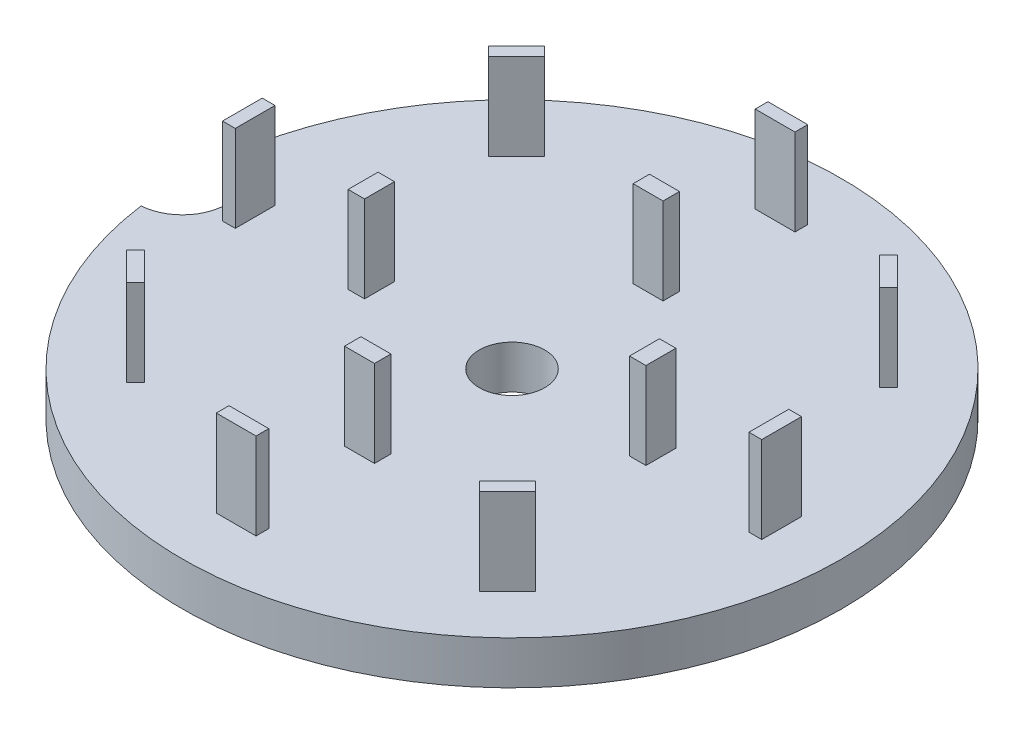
ISO-10303-21;
HEADER;
FILE_DESCRIPTION(('STEP AP214'),'2;1');
FILE_NAME('part.step','',(''),(''),'','','');
FILE_SCHEMA(('AUTOMOTIVE_DESIGN { 1 0 10303 214 1 1 1 1 }'));
ENDSEC;
DATA;
#1=APPLICATION_CONTEXT('core data for automotive mechanical design processes');
#2=APPLICATION_PROTOCOL_DEFINITION('international standard','automotive_design',2000,#1);
#3=PRODUCT_CONTEXT('',#1,'mechanical');
#4=PRODUCT('Part','Part','',(#3));
#5=PRODUCT_RELATED_PRODUCT_CATEGORY('part','',(#4));
#6=PRODUCT_DEFINITION_FORMATION('','',#4);
#7=PRODUCT_DEFINITION_CONTEXT('part definition',#1,'design');
#8=PRODUCT_DEFINITION('design','',#6,#7);
#9=PRODUCT_DEFINITION_SHAPE('','',#8);
#10=(LENGTH_UNIT() NAMED_UNIT(*) SI_UNIT(.MILLI.,.METRE.));
#11=(NAMED_UNIT(*) PLANE_ANGLE_UNIT() SI_UNIT($,.RADIAN.));
#12=(NAMED_UNIT(*) SI_UNIT($,.STERADIAN.) SOLID_ANGLE_UNIT());
#13=UNCERTAINTY_MEASURE_WITH_UNIT(LENGTH_MEASURE(1.E-05),#10,'distance_accuracy_value','');
#14=(GEOMETRIC_REPRESENTATION_CONTEXT(3) GLOBAL_UNCERTAINTY_ASSIGNED_CONTEXT((#13)) GLOBAL_UNIT_ASSIGNED_CONTEXT((#10,
#11,#12)) REPRESENTATION_CONTEXT('',''));
#15=CARTESIAN_POINT('',(0.,0.,0.));
#16=DIRECTION('',(0.,0.,1.));
#17=DIRECTION('',(1.,0.,0.));
#18=AXIS2_PLACEMENT_3D('',#15,#16,#17);
#19=CARTESIAN_POINT('',(-7.61126082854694,2.,0.));
#20=DIRECTION('',(0.,1.,0.));
#21=DIRECTION('',(0.,0.,1.));
#22=AXIS2_PLACEMENT_3D('',#19,#20,#21);
#23=PLANE('',#22);
#24=DIRECTION('',(1.,0.,0.));
#25=VECTOR('',#24,1.);
#26=CARTESIAN_POINT('',(-12.5978338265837,2.,0.774441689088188));
#27=LINE('',#26,#25);
#28=CARTESIAN_POINT('',(-12.5978338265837,2.,0.774441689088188));
#29=VERTEX_POINT('',#28);
#30=CARTESIAN_POINT('',(-12.0083909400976,2.,0.774441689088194));
#31=VERTEX_POINT('',#30);
#32=EDGE_CURVE('E377',#29,#31,#27,.T.);
#33=ORIENTED_EDGE('',*,*,#32,.F.);
#34=DIRECTION('',(0.,0.,1.));
#35=VECTOR('',#34,1.);
#36=CARTESIAN_POINT('',(-12.5978338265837,2.,0.774441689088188));
#37=LINE('',#36,#35);
#38=CARTESIAN_POINT('',(-12.5978338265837,2.,-1.06234443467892));
#39=VERTEX_POINT('',#38);
#40=EDGE_CURVE('E374',#39,#29,#37,.T.);
#41=ORIENTED_EDGE('',*,*,#40,.F.);
#42=DIRECTION('',(-1.,0.,0.));
#43=VECTOR('',#42,1.);
#44=CARTESIAN_POINT('',(-12.5978338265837,2.,-1.06234443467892));
#45=LINE('',#44,#43);
#46=CARTESIAN_POINT('',(-12.0083909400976,2.,-1.06234443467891));
#47=VERTEX_POINT('',#46);
#48=EDGE_CURVE('E386',#47,#39,#45,.T.);
#49=ORIENTED_EDGE('',*,*,#48,.F.);
#50=DIRECTION('',(0.,0.,-1.));
#51=VECTOR('',#50,1.);
#52=CARTESIAN_POINT('',(-12.0083909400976,2.,0.774441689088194));
#53=LINE('',#52,#51);
#54=EDGE_CURVE('E394',#31,#47,#53,.T.);
#55=ORIENTED_EDGE('',*,*,#54,.F.);
#56=EDGE_LOOP('',(#33,#41,#49,#55));
#57=FACE_BOUND('',#56,.T.);
#58=DIRECTION('',(0.,0.,-1.));
#59=VECTOR('',#58,1.);
#60=CARTESIAN_POINT('',(0.774441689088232,2.,12.5978338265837));
#61=LINE('',#60,#59);
#62=CARTESIAN_POINT('',(0.774441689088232,2.,12.5978338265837));
#63=VERTEX_POINT('',#62);
#64=CARTESIAN_POINT('',(0.774441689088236,2.,12.0083909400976));
#65=VERTEX_POINT('',#64);
#66=EDGE_CURVE('E448',#63,#65,#61,.T.);
#67=ORIENTED_EDGE('',*,*,#66,.F.);
#68=DIRECTION('',(1.,0.,0.));
#69=VECTOR('',#68,1.);
#70=CARTESIAN_POINT('',(0.774441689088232,2.,12.5978338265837));
#71=LINE('',#70,#69);
#72=CARTESIAN_POINT('',(-1.06234443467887,2.,12.5978338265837));
#73=VERTEX_POINT('',#72);
#74=EDGE_CURVE('E434',#73,#63,#71,.T.);
#75=ORIENTED_EDGE('',*,*,#74,.F.);
#76=DIRECTION('',(0.,0.,1.));
#77=VECTOR('',#76,1.);
#78=CARTESIAN_POINT('',(-1.06234443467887,2.,12.5978338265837));
#79=LINE('',#78,#77);
#80=CARTESIAN_POINT('',(-1.06234443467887,2.,12.0083909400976));
#81=VERTEX_POINT('',#80);
#82=EDGE_CURVE('E439',#81,#73,#79,.T.);
#83=ORIENTED_EDGE('',*,*,#82,.F.);
#84=DIRECTION('',(-1.,0.,0.));
#85=VECTOR('',#84,1.);
#86=CARTESIAN_POINT('',(0.774441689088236,2.,12.0083909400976));
#87=LINE('',#86,#85);
#88=EDGE_CURVE('E450',#65,#81,#87,.T.);
#89=ORIENTED_EDGE('',*,*,#88,.F.);
#90=EDGE_LOOP('',(#67,#75,#83,#89));
#91=FACE_BOUND('',#90,.T.);
#92=DIRECTION('',(-1.,0.,0.));
#93=VECTOR('',#92,1.);
#94=CARTESIAN_POINT('',(12.5978338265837,2.,-0.774441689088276));
#95=LINE('',#94,#93);
#96=CARTESIAN_POINT('',(12.5978338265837,2.,-0.774441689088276));
#97=VERTEX_POINT('',#96);
#98=CARTESIAN_POINT('',(12.0083909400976,2.,-0.774441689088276));
#99=VERTEX_POINT('',#98);
#100=EDGE_CURVE('E506',#97,#99,#95,.T.);
#101=ORIENTED_EDGE('',*,*,#100,.F.);
#102=DIRECTION('',(0.,0.,-1.));
#103=VECTOR('',#102,1.);
#104=CARTESIAN_POINT('',(12.5978338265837,2.,-0.774441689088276));
#105=LINE('',#104,#103);
#106=CARTESIAN_POINT('',(12.5978338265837,2.,1.06234443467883));
#107=VERTEX_POINT('',#106);
#108=EDGE_CURVE('E492',#107,#97,#105,.T.);
#109=ORIENTED_EDGE('',*,*,#108,.F.);
#110=DIRECTION('',(1.,0.,0.));
#111=VECTOR('',#110,1.);
#112=CARTESIAN_POINT('',(12.5978338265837,2.,1.06234443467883));
#113=LINE('',#112,#111);
#114=CARTESIAN_POINT('',(12.0083909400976,2.,1.06234443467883));
#115=VERTEX_POINT('',#114);
#116=EDGE_CURVE('E497',#115,#107,#113,.T.);
#117=ORIENTED_EDGE('',*,*,#116,.F.);
#118=DIRECTION('',(0.,0.,1.));
#119=VECTOR('',#118,1.);
#120=CARTESIAN_POINT('',(12.0083909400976,2.,-0.774441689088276));
#121=LINE('',#120,#119);
#122=EDGE_CURVE('E508',#99,#115,#121,.T.);
#123=ORIENTED_EDGE('',*,*,#122,.F.);
#124=EDGE_LOOP('',(#101,#109,#117,#123));
#125=FACE_BOUND('',#124,.T.);
#126=DIRECTION('',(0.,0.,-1.));
#127=VECTOR('',#126,1.);
#128=CARTESIAN_POINT('',(-6.20258517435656,2.,0.60886867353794));
#129=LINE('',#128,#127);
#130=CARTESIAN_POINT('',(-6.20258517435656,2.,0.60886867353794));
#131=VERTEX_POINT('',#130);
#132=CARTESIAN_POINT('',(-6.20258517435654,2.,-0.774441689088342));
#133=VERTEX_POINT('',#132);
#134=EDGE_CURVE('E564',#131,#133,#129,.T.);
#135=ORIENTED_EDGE('',*,*,#134,.F.);
#136=DIRECTION('',(1.,0.,0.));
#137=VECTOR('',#136,1.);
#138=CARTESIAN_POINT('',(-6.96117472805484,2.,0.608868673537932));
#139=LINE('',#138,#137);
#140=CARTESIAN_POINT('',(-6.96117472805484,2.,0.608868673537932));
#141=VERTEX_POINT('',#140);
#142=EDGE_CURVE('E550',#141,#131,#139,.T.);
#143=ORIENTED_EDGE('',*,*,#142,.F.);
#144=DIRECTION('',(0.,0.,1.));
#145=VECTOR('',#144,1.);
#146=CARTESIAN_POINT('',(-6.96117472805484,2.,0.608868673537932));
#147=LINE('',#146,#145);
#148=CARTESIAN_POINT('',(-6.96117472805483,2.,-0.77444168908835));
#149=VERTEX_POINT('',#148);
#150=EDGE_CURVE('E555',#149,#141,#147,.T.);
#151=ORIENTED_EDGE('',*,*,#150,.F.);
#152=DIRECTION('',(-1.,0.,0.));
#153=VECTOR('',#152,1.);
#154=CARTESIAN_POINT('',(-6.96117472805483,2.,-0.77444168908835));
#155=LINE('',#154,#153);
#156=EDGE_CURVE('E566',#133,#149,#155,.T.);
#157=ORIENTED_EDGE('',*,*,#156,.F.);
#158=EDGE_LOOP('',(#135,#143,#151,#157));
#159=FACE_BOUND('',#158,.T.);
#160=DIRECTION('',(0.,0.,1.));
#161=VECTOR('',#160,1.);
#162=CARTESIAN_POINT('',(6.20258517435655,2.,-0.608868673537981));
#163=LINE('',#162,#161);
#164=CARTESIAN_POINT('',(6.20258517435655,2.,-0.608868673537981));
#165=VERTEX_POINT('',#164);
#166=CARTESIAN_POINT('',(6.20258517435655,2.,0.774441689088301));
#167=VERTEX_POINT('',#166);
#168=EDGE_CURVE('E622',#165,#167,#163,.T.);
#169=ORIENTED_EDGE('',*,*,#168,.F.);
#170=DIRECTION('',(-1.,0.,0.));
#171=VECTOR('',#170,1.);
#172=CARTESIAN_POINT('',(6.96117472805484,2.,-0.608868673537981));
#173=LINE('',#172,#171);
#174=CARTESIAN_POINT('',(6.96117472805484,2.,-0.608868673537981));
#175=VERTEX_POINT('',#174);
#176=EDGE_CURVE('E608',#175,#165,#173,.T.);
#177=ORIENTED_EDGE('',*,*,#176,.F.);
#178=DIRECTION('',(0.,0.,-1.));
#179=VECTOR('',#178,1.);
#180=CARTESIAN_POINT('',(6.96117472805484,2.,-0.608868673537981));
#181=LINE('',#180,#179);
#182=CARTESIAN_POINT('',(6.96117472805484,2.,0.774441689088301));
#183=VERTEX_POINT('',#182);
#184=EDGE_CURVE('E613',#183,#175,#181,.T.);
#185=ORIENTED_EDGE('',*,*,#184,.F.);
#186=DIRECTION('',(1.,0.,0.));
#187=VECTOR('',#186,1.);
#188=CARTESIAN_POINT('',(6.96117472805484,2.,0.774441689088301));
#189=LINE('',#188,#187);
#190=EDGE_CURVE('E624',#167,#183,#189,.T.);
#191=ORIENTED_EDGE('',*,*,#190,.F.);
#192=EDGE_LOOP('',(#169,#177,#185,#191));
#193=FACE_BOUND('',#192,.T.);
#194=DIRECTION('',(1.,0.,0.));
#195=VECTOR('',#194,1.);
#196=CARTESIAN_POINT('',(-0.608868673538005,2.,-6.20258517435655));
#197=LINE('',#196,#195);
#198=CARTESIAN_POINT('',(-0.608868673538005,2.,-6.20258517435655));
#199=VERTEX_POINT('',#198);
#200=CARTESIAN_POINT('',(0.774441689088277,2.,-6.20258517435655));
#201=VERTEX_POINT('',#200);
#202=EDGE_CURVE('E680',#199,#201,#197,.T.);
#203=ORIENTED_EDGE('',*,*,#202,.F.);
#204=DIRECTION('',(0.,0.,1.));
#205=VECTOR('',#204,1.);
#206=CARTESIAN_POINT('',(-0.608868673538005,2.,-6.96117472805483));
#207=LINE('',#206,#205);
#208=CARTESIAN_POINT('',(-0.608868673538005,2.,-6.96117472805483));
#209=VERTEX_POINT('',#208);
#210=EDGE_CURVE('E666',#209,#199,#207,.T.);
#211=ORIENTED_EDGE('',*,*,#210,.F.);
#212=DIRECTION('',(-1.,0.,0.));
#213=VECTOR('',#212,1.);
#214=CARTESIAN_POINT('',(-0.608868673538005,2.,-6.96117472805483));
#215=LINE('',#214,#213);
#216=CARTESIAN_POINT('',(0.774441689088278,2.,-6.96117472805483));
#217=VERTEX_POINT('',#216);
#218=EDGE_CURVE('E671',#217,#209,#215,.T.);
#219=ORIENTED_EDGE('',*,*,#218,.F.);
#220=DIRECTION('',(0.,0.,-1.));
#221=VECTOR('',#220,1.);
#222=CARTESIAN_POINT('',(0.774441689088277,2.,-6.96117472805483));
#223=LINE('',#222,#221);
#224=EDGE_CURVE('E682',#201,#217,#223,.T.);
#225=ORIENTED_EDGE('',*,*,#224,.F.);
#226=EDGE_LOOP('',(#203,#211,#219,#225));
#227=FACE_BOUND('',#226,.T.);
#228=CARTESIAN_POINT('',(0.,2.,0.));
#229=DIRECTION('',(0.,1.,0.));
#230=DIRECTION('',(0.,0.,1.));
#231=AXIS2_PLACEMENT_3D('',#228,#229,#230);
#232=CIRCLE('',#231,1.51270991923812);
#233=CARTESIAN_POINT('',(0.,2.,1.51270991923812));
#234=VERTEX_POINT('',#233);
#235=EDGE_CURVE('E695',#234,#234,#232,.T.);
#236=ORIENTED_EDGE('',*,*,#235,.F.);
#237=EDGE_LOOP('',(#236));
#238=FACE_BOUND('',#237,.T.);
#239=CARTESIAN_POINT('',(-15.2225216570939,2.,0.));
#240=DIRECTION('',(0.,-1.,0.));
#241=DIRECTION('',(0.,0.,1.));
#242=AXIS2_PLACEMENT_3D('',#239,#240,#241);
#243=CIRCLE('',#242,2.05423721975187);
#244=CARTESIAN_POINT('',(-15.0839148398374,2.,-2.04955573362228));
#245=VERTEX_POINT('',#244);
#246=CARTESIAN_POINT('',(-15.0839148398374,2.,2.04955573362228));
#247=VERTEX_POINT('',#246);
#248=EDGE_CURVE('E702',#245,#247,#243,.T.);
#249=ORIENTED_EDGE('',*,*,#248,.T.);
#250=CARTESIAN_POINT('',(0.,2.,0.));
#251=DIRECTION('',(0.,1.,0.));
#252=DIRECTION('',(0.,0.,1.));
#253=AXIS2_PLACEMENT_3D('',#250,#251,#252);
#254=CIRCLE('',#253,15.2225216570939);
#255=EDGE_CURVE('E705',#247,#245,#254,.T.);
#256=ORIENTED_EDGE('',*,*,#255,.T.);
#257=EDGE_LOOP('',(#249,#256));
#258=FACE_BOUND('',#257,.T.);
#259=DIRECTION('',(1.,0.,0.));
#260=VECTOR('',#259,1.);
#261=CARTESIAN_POINT('',(-0.77444168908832,2.,-12.0083909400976));
#262=LINE('',#261,#260);
#263=CARTESIAN_POINT('',(-0.77444168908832,2.,-12.0083909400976));
#264=VERTEX_POINT('',#263);
#265=CARTESIAN_POINT('',(1.06234443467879,2.,-12.0083909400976));
#266=VERTEX_POINT('',#265);
#267=EDGE_CURVE('E651',#264,#266,#262,.T.);
#268=ORIENTED_EDGE('',*,*,#267,.F.);
#269=DIRECTION('',(0.,0.,1.));
#270=VECTOR('',#269,1.);
#271=CARTESIAN_POINT('',(-0.77444168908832,2.,-12.5978338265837));
#272=LINE('',#271,#270);
#273=CARTESIAN_POINT('',(-0.77444168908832,2.,-12.5978338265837));
#274=VERTEX_POINT('',#273);
#275=EDGE_CURVE('E637',#274,#264,#272,.T.);
#276=ORIENTED_EDGE('',*,*,#275,.F.);
#277=DIRECTION('',(-1.,0.,0.));
#278=VECTOR('',#277,1.);
#279=CARTESIAN_POINT('',(-0.77444168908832,2.,-12.5978338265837));
#280=LINE('',#279,#278);
#281=CARTESIAN_POINT('',(1.06234443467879,2.,-12.5978338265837));
#282=VERTEX_POINT('',#281);
#283=EDGE_CURVE('E642',#282,#274,#280,.T.);
#284=ORIENTED_EDGE('',*,*,#283,.F.);
#285=DIRECTION('',(0.,0.,-1.));
#286=VECTOR('',#285,1.);
#287=CARTESIAN_POINT('',(1.06234443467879,2.,-12.5978338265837));
#288=LINE('',#287,#286);
#289=EDGE_CURVE('E653',#266,#282,#288,.T.);
#290=ORIENTED_EDGE('',*,*,#289,.F.);
#291=EDGE_LOOP('',(#268,#276,#284,#290));
#292=FACE_BOUND('',#291,.T.);
#293=DIRECTION('',(-1.,0.,0.));
#294=VECTOR('',#293,1.);
#295=CARTESIAN_POINT('',(0.608868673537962,2.,6.20258517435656));
#296=LINE('',#295,#294);
#297=CARTESIAN_POINT('',(0.608868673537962,2.,6.20258517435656));
#298=VERTEX_POINT('',#297);
#299=CARTESIAN_POINT('',(-0.77444168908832,2.,6.20258517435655));
#300=VERTEX_POINT('',#299);
#301=EDGE_CURVE('E593',#298,#300,#296,.T.);
#302=ORIENTED_EDGE('',*,*,#301,.F.);
#303=DIRECTION('',(0.,0.,-1.));
#304=VECTOR('',#303,1.);
#305=CARTESIAN_POINT('',(0.608868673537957,2.,6.96117472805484));
#306=LINE('',#305,#304);
#307=CARTESIAN_POINT('',(0.608868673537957,2.,6.96117472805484));
#308=VERTEX_POINT('',#307);
#309=EDGE_CURVE('E579',#308,#298,#306,.T.);
#310=ORIENTED_EDGE('',*,*,#309,.F.);
#311=DIRECTION('',(1.,0.,0.));
#312=VECTOR('',#311,1.);
#313=CARTESIAN_POINT('',(0.608868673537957,2.,6.96117472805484));
#314=LINE('',#313,#312);
#315=CARTESIAN_POINT('',(-0.774441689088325,2.,6.96117472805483));
#316=VERTEX_POINT('',#315);
#317=EDGE_CURVE('E584',#316,#308,#314,.T.);
#318=ORIENTED_EDGE('',*,*,#317,.F.);
#319=DIRECTION('',(0.,0.,1.));
#320=VECTOR('',#319,1.);
#321=CARTESIAN_POINT('',(-0.774441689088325,2.,6.96117472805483));
#322=LINE('',#321,#320);
#323=EDGE_CURVE('E595',#300,#316,#322,.T.);
#324=ORIENTED_EDGE('',*,*,#323,.F.);
#325=EDGE_LOOP('',(#302,#310,#318,#324));
#326=FACE_BOUND('',#325,.T.);
#327=DIRECTION('',(-0.707106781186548,0.,0.707106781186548));
#328=VECTOR('',#327,1.);
#329=CARTESIAN_POINT('',(8.36040075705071,2.,-9.45562669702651));
#330=LINE('',#329,#328);
#331=CARTESIAN_POINT('',(8.36040075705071,2.,-9.45562669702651));
#332=VERTEX_POINT('',#331);
#333=CARTESIAN_POINT('',(7.94360169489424,2.,-9.03882763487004));
#334=VERTEX_POINT('',#333);
#335=EDGE_CURVE('E535',#332,#334,#330,.T.);
#336=ORIENTED_EDGE('',*,*,#335,.F.);
#337=DIRECTION('',(-0.707106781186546,0.,-0.707106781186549));
#338=VECTOR('',#337,1.);
#339=CARTESIAN_POINT('',(8.36040075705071,2.,-9.45562669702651));
#340=LINE('',#339,#338);
#341=CARTESIAN_POINT('',(9.65920468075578,2.,-8.15682277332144));
#342=VERTEX_POINT('',#341);
#343=EDGE_CURVE('E521',#342,#332,#340,.T.);
#344=ORIENTED_EDGE('',*,*,#343,.F.);
#345=DIRECTION('',(0.707106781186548,0.,-0.707106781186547));
#346=VECTOR('',#345,1.);
#347=CARTESIAN_POINT('',(9.65920468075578,2.,-8.15682277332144));
#348=LINE('',#347,#346);
#349=CARTESIAN_POINT('',(9.24240561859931,2.,-7.74002371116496));
#350=VERTEX_POINT('',#349);
#351=EDGE_CURVE('E526',#350,#342,#348,.T.);
#352=ORIENTED_EDGE('',*,*,#351,.F.);
#353=DIRECTION('',(0.707106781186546,0.,0.707106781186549));
#354=VECTOR('',#353,1.);
#355=CARTESIAN_POINT('',(7.94360169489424,2.,-9.03882763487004));
#356=LINE('',#355,#354);
#357=EDGE_CURVE('E537',#334,#350,#356,.T.);
#358=ORIENTED_EDGE('',*,*,#357,.F.);
#359=EDGE_LOOP('',(#336,#344,#352,#358));
#360=FACE_BOUND('',#359,.T.);
#361=DIRECTION('',(-0.707106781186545,0.,-0.70710678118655));
#362=VECTOR('',#361,1.);
#363=CARTESIAN_POINT('',(9.45562669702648,2.,8.36040075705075));
#364=LINE('',#363,#362);
#365=CARTESIAN_POINT('',(9.45562669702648,2.,8.36040075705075));
#366=VERTEX_POINT('',#365);
#367=CARTESIAN_POINT('',(9.03882763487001,2.,7.94360169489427));
#368=VERTEX_POINT('',#367);
#369=EDGE_CURVE('E477',#366,#368,#364,.T.);
#370=ORIENTED_EDGE('',*,*,#369,.F.);
#371=DIRECTION('',(0.707106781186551,0.,-0.707106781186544));
#372=VECTOR('',#371,1.);
#373=CARTESIAN_POINT('',(9.45562669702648,2.,8.36040075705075));
#374=LINE('',#373,#372);
#375=CARTESIAN_POINT('',(8.1568227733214,2.,9.65920468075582));
#376=VERTEX_POINT('',#375);
#377=EDGE_CURVE('E463',#376,#366,#374,.T.);
#378=ORIENTED_EDGE('',*,*,#377,.F.);
#379=DIRECTION('',(0.707106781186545,0.,0.70710678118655));
#380=VECTOR('',#379,1.);
#381=CARTESIAN_POINT('',(8.1568227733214,2.,9.65920468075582));
#382=LINE('',#381,#380);
#383=CARTESIAN_POINT('',(7.74002371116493,2.,9.24240561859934));
#384=VERTEX_POINT('',#383);
#385=EDGE_CURVE('E468',#384,#376,#382,.T.);
#386=ORIENTED_EDGE('',*,*,#385,.F.);
#387=DIRECTION('',(-0.707106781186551,0.,0.707106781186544));
#388=VECTOR('',#387,1.);
#389=CARTESIAN_POINT('',(9.03882763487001,2.,7.94360169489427));
#390=LINE('',#389,#388);
#391=EDGE_CURVE('E479',#368,#384,#390,.T.);
#392=ORIENTED_EDGE('',*,*,#391,.F.);
#393=EDGE_LOOP('',(#370,#378,#386,#392));
#394=FACE_BOUND('',#393,.T.);
#395=DIRECTION('',(0.707106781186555,0.,-0.70710678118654));
#396=VECTOR('',#395,1.);
#397=CARTESIAN_POINT('',(-8.36040075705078,2.,9.45562669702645));
#398=LINE('',#397,#396);
#399=CARTESIAN_POINT('',(-8.36040075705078,2.,9.45562669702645));
#400=VERTEX_POINT('',#399);
#401=CARTESIAN_POINT('',(-7.9436016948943,2.,9.03882763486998));
#402=VERTEX_POINT('',#401);
#403=EDGE_CURVE('E419',#400,#402,#398,.T.);
#404=ORIENTED_EDGE('',*,*,#403,.F.);
#405=DIRECTION('',(0.707106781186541,0.,0.707106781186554));
#406=VECTOR('',#405,1.);
#407=CARTESIAN_POINT('',(-8.36040075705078,2.,9.45562669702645));
#408=LINE('',#407,#406);
#409=CARTESIAN_POINT('',(-9.65920468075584,2.,8.15682277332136));
#410=VERTEX_POINT('',#409);
#411=EDGE_CURVE('E405',#410,#400,#408,.T.);
#412=ORIENTED_EDGE('',*,*,#411,.F.);
#413=DIRECTION('',(-0.707106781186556,0.,0.707106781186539));
#414=VECTOR('',#413,1.);
#415=CARTESIAN_POINT('',(-9.65920468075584,2.,8.15682277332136));
#416=LINE('',#415,#414);
#417=CARTESIAN_POINT('',(-9.24240561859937,2.,7.7400237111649));
#418=VERTEX_POINT('',#417);
#419=EDGE_CURVE('E410',#418,#410,#416,.T.);
#420=ORIENTED_EDGE('',*,*,#419,.F.);
#421=DIRECTION('',(-0.707106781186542,0.,-0.707106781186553));
#422=VECTOR('',#421,1.);
#423=CARTESIAN_POINT('',(-7.9436016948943,2.,9.03882763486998));
#424=LINE('',#423,#422);
#425=EDGE_CURVE('E421',#402,#418,#424,.T.);
#426=ORIENTED_EDGE('',*,*,#425,.F.);
#427=EDGE_LOOP('',(#404,#412,#420,#426));
#428=FACE_BOUND('',#427,.T.);
#429=DIRECTION('',(0.707106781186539,0.,0.707106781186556));
#430=VECTOR('',#429,1.);
#431=CARTESIAN_POINT('',(-9.45562669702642,2.,-8.36040075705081));
#432=LINE('',#431,#430);
#433=CARTESIAN_POINT('',(-9.45562669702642,2.,-8.36040075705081));
#434=VERTEX_POINT('',#433);
#435=CARTESIAN_POINT('',(-9.03882763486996,2.,-7.94360169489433));
#436=VERTEX_POINT('',#435);
#437=EDGE_CURVE('E746',#434,#436,#432,.T.);
#438=ORIENTED_EDGE('',*,*,#437,.F.);
#439=DIRECTION('',(-0.707106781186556,0.,0.70710678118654));
#440=VECTOR('',#439,1.);
#441=CARTESIAN_POINT('',(-9.45562669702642,2.,-8.36040075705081));
#442=LINE('',#441,#440);
#443=CARTESIAN_POINT('',(-8.15682277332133,2.,-9.65920468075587));
#444=VERTEX_POINT('',#443);
#445=EDGE_CURVE('E372',#444,#434,#442,.T.);
#446=ORIENTED_EDGE('',*,*,#445,.F.);
#447=DIRECTION('',(-0.707106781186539,0.,-0.707106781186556));
#448=VECTOR('',#447,1.);
#449=CARTESIAN_POINT('',(-8.15682277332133,2.,-9.65920468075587));
#450=LINE('',#449,#448);
#451=CARTESIAN_POINT('',(-7.74002371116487,2.,-9.24240561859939));
#452=VERTEX_POINT('',#451);
#453=EDGE_CURVE('E368',#452,#444,#450,.T.);
#454=ORIENTED_EDGE('',*,*,#453,.F.);
#455=DIRECTION('',(0.707106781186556,0.,-0.70710678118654));
#456=VECTOR('',#455,1.);
#457=CARTESIAN_POINT('',(-9.03882763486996,2.,-7.94360169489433));
#458=LINE('',#457,#456);
#459=EDGE_CURVE('E748',#436,#452,#458,.T.);
#460=ORIENTED_EDGE('',*,*,#459,.F.);
#461=EDGE_LOOP('',(#438,#446,#454,#460));
#462=FACE_BOUND('',#461,.T.);
#463=ADVANCED_FACE('F31',(#57,#91,#125,#159,#193,#227,#238,#258,#292,#326,#360,#394,#428,#462),
#23,.T.);
#464=CARTESIAN_POINT('',(-15.2225216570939,2.,0.));
#465=DIRECTION('',(0.,-1.,0.));
#466=DIRECTION('',(0.,0.,-1.));
#467=AXIS2_PLACEMENT_3D('',#464,#465,#466);
#468=CYLINDRICAL_SURFACE('',#467,2.05423721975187);
#469=CARTESIAN_POINT('',(-15.2225216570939,0.,0.));
#470=DIRECTION('',(0.,-1.,0.));
#471=DIRECTION('',(0.,0.,1.));
#472=AXIS2_PLACEMENT_3D('',#469,#470,#471);
#473=CIRCLE('',#472,2.05423721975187);
#474=CARTESIAN_POINT('',(-15.0839148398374,0.,-2.04955573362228));
#475=VERTEX_POINT('',#474);
#476=CARTESIAN_POINT('',(-15.0839148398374,0.,2.04955573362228));
#477=VERTEX_POINT('',#476);
#478=EDGE_CURVE('E699',#475,#477,#473,.T.);
#479=ORIENTED_EDGE('',*,*,#478,.T.);
#480=DIRECTION('',(0.,-1.,0.));
#481=VECTOR('',#480,1.);
#482=CARTESIAN_POINT('',(-15.0839148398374,2.,2.04955573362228));
#483=LINE('',#482,#481);
#484=EDGE_CURVE('E11',#247,#477,#483,.T.);
#485=ORIENTED_EDGE('',*,*,#484,.F.);
#486=ORIENTED_EDGE('',*,*,#248,.F.);
#487=DIRECTION('',(0.,-1.,0.));
#488=VECTOR('',#487,1.);
#489=CARTESIAN_POINT('',(-15.0839148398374,2.,-2.04955573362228));
#490=LINE('',#489,#488);
#491=EDGE_CURVE('E39',#245,#475,#490,.T.);
#492=ORIENTED_EDGE('',*,*,#491,.T.);
#493=EDGE_LOOP('',(#479,#485,#486,#492));
#494=FACE_BOUND('',#493,.T.);
#495=ADVANCED_FACE('F33',(#494),#468,.F.);
#496=CARTESIAN_POINT('',(0.,2.,0.));
#497=DIRECTION('',(0.,-1.,0.));
#498=DIRECTION('',(0.,0.,-1.));
#499=AXIS2_PLACEMENT_3D('',#496,#497,#498);
#500=CYLINDRICAL_SURFACE('',#499,15.2225216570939);
#501=CARTESIAN_POINT('',(0.,0.,0.));
#502=DIRECTION('',(0.,1.,0.));
#503=DIRECTION('',(0.,0.,1.));
#504=AXIS2_PLACEMENT_3D('',#501,#502,#503);
#505=CIRCLE('',#504,15.2225216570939);
#506=EDGE_CURVE('E706',#477,#475,#505,.T.);
#507=ORIENTED_EDGE('',*,*,#506,.T.);
#508=ORIENTED_EDGE('',*,*,#491,.F.);
#509=ORIENTED_EDGE('',*,*,#255,.F.);
#510=ORIENTED_EDGE('',*,*,#484,.T.);
#511=EDGE_LOOP('',(#507,#508,#509,#510));
#512=FACE_BOUND('',#511,.T.);
#513=ADVANCED_FACE('F719',(#512),#500,.T.);
#514=CARTESIAN_POINT('',(-7.61126082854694,0.,0.));
#515=DIRECTION('',(0.,1.,0.));
#516=DIRECTION('',(0.,0.,1.));
#517=AXIS2_PLACEMENT_3D('',#514,#515,#516);
#518=PLANE('',#517);
#519=CARTESIAN_POINT('',(0.,0.,0.));
#520=DIRECTION('',(0.,1.,0.));
#521=DIRECTION('',(0.,0.,1.));
#522=AXIS2_PLACEMENT_3D('',#519,#520,#521);
#523=CIRCLE('',#522,1.51270991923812);
#524=CARTESIAN_POINT('',(0.,0.,1.51270991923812));
#525=VERTEX_POINT('',#524);
#526=EDGE_CURVE('E696',#525,#525,#523,.T.);
#527=ORIENTED_EDGE('',*,*,#526,.T.);
#528=EDGE_LOOP('',(#527));
#529=FACE_BOUND('',#528,.T.);
#530=ORIENTED_EDGE('',*,*,#478,.F.);
#531=ORIENTED_EDGE('',*,*,#506,.F.);
#532=EDGE_LOOP('',(#530,#531));
#533=FACE_BOUND('',#532,.T.);
#534=ADVANCED_FACE('F718',(#529,#533),#518,.F.);
#535=CARTESIAN_POINT('',(0.,0.,0.));
#536=DIRECTION('',(0.,1.,0.));
#537=DIRECTION('',(0.,0.,1.));
#538=AXIS2_PLACEMENT_3D('',#535,#536,#537);
#539=CYLINDRICAL_SURFACE('',#538,1.51270991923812);
#540=ORIENTED_EDGE('',*,*,#526,.F.);
#541=EDGE_LOOP('',(#540));
#542=FACE_BOUND('',#541,.T.);
#543=ORIENTED_EDGE('',*,*,#235,.T.);
#544=EDGE_LOOP('',(#543));
#545=FACE_BOUND('',#544,.T.);
#546=ADVANCED_FACE('F991',(#542,#545),#539,.F.);
#547=CARTESIAN_POINT('',(-0.608868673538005,6.,-6.96117472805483));
#548=DIRECTION('',(1.,0.,0.));
#549=DIRECTION('',(0.,0.,-1.));
#550=AXIS2_PLACEMENT_3D('',#547,#548,#549);
#551=PLANE('',#550);
#552=ORIENTED_EDGE('',*,*,#210,.T.);
#553=DIRECTION('',(0.,-1.,0.));
#554=VECTOR('',#553,1.);
#555=CARTESIAN_POINT('',(-0.608868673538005,6.,-6.20258517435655));
#556=LINE('',#555,#554);
#557=CARTESIAN_POINT('',(-0.608868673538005,6.,-6.20258517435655));
#558=VERTEX_POINT('',#557);
#559=EDGE_CURVE('E693',#558,#199,#556,.T.);
#560=ORIENTED_EDGE('',*,*,#559,.F.);
#561=DIRECTION('',(0.,0.,1.));
#562=VECTOR('',#561,1.);
#563=CARTESIAN_POINT('',(-0.608868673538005,6.,-6.96117472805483));
#564=LINE('',#563,#562);
#565=CARTESIAN_POINT('',(-0.608868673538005,6.,-6.96117472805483));
#566=VERTEX_POINT('',#565);
#567=EDGE_CURVE('E667',#566,#558,#564,.T.);
#568=ORIENTED_EDGE('',*,*,#567,.F.);
#569=DIRECTION('',(0.,-1.,0.));
#570=VECTOR('',#569,1.);
#571=CARTESIAN_POINT('',(-0.608868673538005,6.,-6.96117472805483));
#572=LINE('',#571,#570);
#573=EDGE_CURVE('E677',#566,#209,#572,.T.);
#574=ORIENTED_EDGE('',*,*,#573,.T.);
#575=EDGE_LOOP('',(#552,#560,#568,#574));
#576=FACE_BOUND('',#575,.T.);
#577=ADVANCED_FACE('F987',(#576),#551,.F.);
#578=CARTESIAN_POINT('',(-0.608868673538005,6.,-6.20258517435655));
#579=DIRECTION('',(0.,0.,-1.));
#580=DIRECTION('',(-1.,0.,0.));
#581=AXIS2_PLACEMENT_3D('',#578,#579,#580);
#582=PLANE('',#581);
#583=ORIENTED_EDGE('',*,*,#202,.T.);
#584=DIRECTION('',(0.,-1.,0.));
#585=VECTOR('',#584,1.);
#586=CARTESIAN_POINT('',(0.774441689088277,6.,-6.20258517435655));
#587=LINE('',#586,#585);
#588=CARTESIAN_POINT('',(0.774441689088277,6.,-6.20258517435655));
#589=VERTEX_POINT('',#588);
#590=EDGE_CURVE('E690',#589,#201,#587,.T.);
#591=ORIENTED_EDGE('',*,*,#590,.F.);
#592=DIRECTION('',(1.,0.,0.));
#593=VECTOR('',#592,1.);
#594=CARTESIAN_POINT('',(-0.608868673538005,6.,-6.20258517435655));
#595=LINE('',#594,#593);
#596=EDGE_CURVE('E670',#558,#589,#595,.T.);
#597=ORIENTED_EDGE('',*,*,#596,.F.);
#598=ORIENTED_EDGE('',*,*,#559,.T.);
#599=EDGE_LOOP('',(#583,#591,#597,#598));
#600=FACE_BOUND('',#599,.T.);
#601=ADVANCED_FACE('F983',(#600),#582,.F.);
#602=CARTESIAN_POINT('',(0.774441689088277,6.,-6.96117472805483));
#603=DIRECTION('',(-1.,0.,0.));
#604=DIRECTION('',(0.,0.,1.));
#605=AXIS2_PLACEMENT_3D('',#602,#603,#604);
#606=PLANE('',#605);
#607=ORIENTED_EDGE('',*,*,#224,.T.);
#608=DIRECTION('',(0.,-1.,0.));
#609=VECTOR('',#608,1.);
#610=CARTESIAN_POINT('',(0.774441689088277,6.,-6.96117472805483));
#611=LINE('',#610,#609);
#612=CARTESIAN_POINT('',(0.774441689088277,6.,-6.96117472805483));
#613=VERTEX_POINT('',#612);
#614=EDGE_CURVE('E688',#613,#217,#611,.T.);
#615=ORIENTED_EDGE('',*,*,#614,.F.);
#616=DIRECTION('',(0.,0.,-1.));
#617=VECTOR('',#616,1.);
#618=CARTESIAN_POINT('',(0.774441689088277,6.,-6.96117472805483));
#619=LINE('',#618,#617);
#620=EDGE_CURVE('E673',#589,#613,#619,.T.);
#621=ORIENTED_EDGE('',*,*,#620,.F.);
#622=ORIENTED_EDGE('',*,*,#590,.T.);
#623=EDGE_LOOP('',(#607,#615,#621,#622));
#624=FACE_BOUND('',#623,.T.);
#625=ADVANCED_FACE('F979',(#624),#606,.F.);
#626=CARTESIAN_POINT('',(-0.608868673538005,6.,-6.96117472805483));
#627=DIRECTION('',(0.,0.,1.));
#628=DIRECTION('',(1.,0.,0.));
#629=AXIS2_PLACEMENT_3D('',#626,#627,#628);
#630=PLANE('',#629);
#631=ORIENTED_EDGE('',*,*,#218,.T.);
#632=ORIENTED_EDGE('',*,*,#573,.F.);
#633=DIRECTION('',(-1.,0.,0.));
#634=VECTOR('',#633,1.);
#635=CARTESIAN_POINT('',(-0.608868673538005,6.,-6.96117472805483));
#636=LINE('',#635,#634);
#637=EDGE_CURVE('E675',#613,#566,#636,.T.);
#638=ORIENTED_EDGE('',*,*,#637,.F.);
#639=ORIENTED_EDGE('',*,*,#614,.T.);
#640=EDGE_LOOP('',(#631,#632,#638,#639));
#641=FACE_BOUND('',#640,.T.);
#642=ADVANCED_FACE('F975',(#641),#630,.F.);
#643=CARTESIAN_POINT('',(-0.608868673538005,6.,-6.20258517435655));
#644=DIRECTION('',(0.,1.,0.));
#645=DIRECTION('',(0.,0.,1.));
#646=AXIS2_PLACEMENT_3D('',#643,#644,#645);
#647=PLANE('',#646);
#648=ORIENTED_EDGE('',*,*,#567,.T.);
#649=ORIENTED_EDGE('',*,*,#596,.T.);
#650=ORIENTED_EDGE('',*,*,#620,.T.);
#651=ORIENTED_EDGE('',*,*,#637,.T.);
#652=EDGE_LOOP('',(#648,#649,#650,#651));
#653=FACE_BOUND('',#652,.T.);
#654=ADVANCED_FACE('F971',(#653),#647,.T.);
#655=CARTESIAN_POINT('',(-0.77444168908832,6.,-12.5978338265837));
#656=DIRECTION('',(1.,0.,0.));
#657=DIRECTION('',(0.,0.,-1.));
#658=AXIS2_PLACEMENT_3D('',#655,#656,#657);
#659=PLANE('',#658);
#660=ORIENTED_EDGE('',*,*,#275,.T.);
#661=DIRECTION('',(0.,-1.,0.));
#662=VECTOR('',#661,1.);
#663=CARTESIAN_POINT('',(-0.77444168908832,6.,-12.0083909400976));
#664=LINE('',#663,#662);
#665=CARTESIAN_POINT('',(-0.77444168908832,6.,-12.0083909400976));
#666=VERTEX_POINT('',#665);
#667=EDGE_CURVE('E664',#666,#264,#664,.T.);
#668=ORIENTED_EDGE('',*,*,#667,.F.);
#669=DIRECTION('',(0.,0.,1.));
#670=VECTOR('',#669,1.);
#671=CARTESIAN_POINT('',(-0.77444168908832,6.,-12.5978338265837));
#672=LINE('',#671,#670);
#673=CARTESIAN_POINT('',(-0.77444168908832,6.,-12.5978338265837));
#674=VERTEX_POINT('',#673);
#675=EDGE_CURVE('E638',#674,#666,#672,.T.);
#676=ORIENTED_EDGE('',*,*,#675,.F.);
#677=DIRECTION('',(0.,-1.,0.));
#678=VECTOR('',#677,1.);
#679=CARTESIAN_POINT('',(-0.77444168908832,6.,-12.5978338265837));
#680=LINE('',#679,#678);
#681=EDGE_CURVE('E648',#674,#274,#680,.T.);
#682=ORIENTED_EDGE('',*,*,#681,.T.);
#683=EDGE_LOOP('',(#660,#668,#676,#682));
#684=FACE_BOUND('',#683,.T.);
#685=ADVANCED_FACE('F967',(#684),#659,.F.);
#686=CARTESIAN_POINT('',(-0.77444168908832,6.,-12.0083909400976));
#687=DIRECTION('',(0.,0.,-1.));
#688=DIRECTION('',(-1.,0.,0.));
#689=AXIS2_PLACEMENT_3D('',#686,#687,#688);
#690=PLANE('',#689);
#691=ORIENTED_EDGE('',*,*,#267,.T.);
#692=DIRECTION('',(0.,-1.,0.));
#693=VECTOR('',#692,1.);
#694=CARTESIAN_POINT('',(1.06234443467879,6.,-12.0083909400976));
#695=LINE('',#694,#693);
#696=CARTESIAN_POINT('',(1.06234443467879,6.,-12.0083909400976));
#697=VERTEX_POINT('',#696);
#698=EDGE_CURVE('E661',#697,#266,#695,.T.);
#699=ORIENTED_EDGE('',*,*,#698,.F.);
#700=DIRECTION('',(1.,0.,0.));
#701=VECTOR('',#700,1.);
#702=CARTESIAN_POINT('',(-0.77444168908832,6.,-12.0083909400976));
#703=LINE('',#702,#701);
#704=EDGE_CURVE('E641',#666,#697,#703,.T.);
#705=ORIENTED_EDGE('',*,*,#704,.F.);
#706=ORIENTED_EDGE('',*,*,#667,.T.);
#707=EDGE_LOOP('',(#691,#699,#705,#706));
#708=FACE_BOUND('',#707,.T.);
#709=ADVANCED_FACE('F963',(#708),#690,.F.);
#710=CARTESIAN_POINT('',(1.06234443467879,6.,-12.5978338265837));
#711=DIRECTION('',(-1.,0.,0.));
#712=DIRECTION('',(0.,0.,1.));
#713=AXIS2_PLACEMENT_3D('',#710,#711,#712);
#714=PLANE('',#713);
#715=ORIENTED_EDGE('',*,*,#289,.T.);
#716=DIRECTION('',(0.,-1.,0.));
#717=VECTOR('',#716,1.);
#718=CARTESIAN_POINT('',(1.06234443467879,6.,-12.5978338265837));
#719=LINE('',#718,#717);
#720=CARTESIAN_POINT('',(1.06234443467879,6.,-12.5978338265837));
#721=VERTEX_POINT('',#720);
#722=EDGE_CURVE('E659',#721,#282,#719,.T.);
#723=ORIENTED_EDGE('',*,*,#722,.F.);
#724=DIRECTION('',(0.,0.,-1.));
#725=VECTOR('',#724,1.);
#726=CARTESIAN_POINT('',(1.06234443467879,6.,-12.5978338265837));
#727=LINE('',#726,#725);
#728=EDGE_CURVE('E644',#697,#721,#727,.T.);
#729=ORIENTED_EDGE('',*,*,#728,.F.);
#730=ORIENTED_EDGE('',*,*,#698,.T.);
#731=EDGE_LOOP('',(#715,#723,#729,#730));
#732=FACE_BOUND('',#731,.T.);
#733=ADVANCED_FACE('F959',(#732),#714,.F.);
#734=CARTESIAN_POINT('',(-0.77444168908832,6.,-12.5978338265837));
#735=DIRECTION('',(0.,0.,1.));
#736=DIRECTION('',(1.,0.,0.));
#737=AXIS2_PLACEMENT_3D('',#734,#735,#736);
#738=PLANE('',#737);
#739=ORIENTED_EDGE('',*,*,#283,.T.);
#740=ORIENTED_EDGE('',*,*,#681,.F.);
#741=DIRECTION('',(-1.,0.,0.));
#742=VECTOR('',#741,1.);
#743=CARTESIAN_POINT('',(-0.77444168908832,6.,-12.5978338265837));
#744=LINE('',#743,#742);
#745=EDGE_CURVE('E646',#721,#674,#744,.T.);
#746=ORIENTED_EDGE('',*,*,#745,.F.);
#747=ORIENTED_EDGE('',*,*,#722,.T.);
#748=EDGE_LOOP('',(#739,#740,#746,#747));
#749=FACE_BOUND('',#748,.T.);
#750=ADVANCED_FACE('F955',(#749),#738,.F.);
#751=CARTESIAN_POINT('',(-0.77444168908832,6.,-12.0083909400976));
#752=DIRECTION('',(0.,1.,0.));
#753=DIRECTION('',(0.,0.,1.));
#754=AXIS2_PLACEMENT_3D('',#751,#752,#753);
#755=PLANE('',#754);
#756=ORIENTED_EDGE('',*,*,#675,.T.);
#757=ORIENTED_EDGE('',*,*,#704,.T.);
#758=ORIENTED_EDGE('',*,*,#728,.T.);
#759=ORIENTED_EDGE('',*,*,#745,.T.);
#760=EDGE_LOOP('',(#756,#757,#758,#759));
#761=FACE_BOUND('',#760,.T.);
#762=ADVANCED_FACE('F951',(#761),#755,.T.);
#763=CARTESIAN_POINT('',(6.96117472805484,6.,-0.608868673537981));
#764=DIRECTION('',(0.,0.,1.));
#765=DIRECTION('',(1.,0.,0.));
#766=AXIS2_PLACEMENT_3D('',#763,#764,#765);
#767=PLANE('',#766);
#768=ORIENTED_EDGE('',*,*,#176,.T.);
#769=DIRECTION('',(0.,-1.,0.));
#770=VECTOR('',#769,1.);
#771=CARTESIAN_POINT('',(6.20258517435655,6.,-0.608868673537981));
#772=LINE('',#771,#770);
#773=CARTESIAN_POINT('',(6.20258517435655,6.,-0.608868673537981));
#774=VERTEX_POINT('',#773);
#775=EDGE_CURVE('E635',#774,#165,#772,.T.);
#776=ORIENTED_EDGE('',*,*,#775,.F.);
#777=DIRECTION('',(-1.,0.,0.));
#778=VECTOR('',#777,1.);
#779=CARTESIAN_POINT('',(6.96117472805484,6.,-0.608868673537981));
#780=LINE('',#779,#778);
#781=CARTESIAN_POINT('',(6.96117472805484,6.,-0.608868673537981));
#782=VERTEX_POINT('',#781);
#783=EDGE_CURVE('E609',#782,#774,#780,.T.);
#784=ORIENTED_EDGE('',*,*,#783,.F.);
#785=DIRECTION('',(0.,-1.,0.));
#786=VECTOR('',#785,1.);
#787=CARTESIAN_POINT('',(6.96117472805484,6.,-0.608868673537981));
#788=LINE('',#787,#786);
#789=EDGE_CURVE('E619',#782,#175,#788,.T.);
#790=ORIENTED_EDGE('',*,*,#789,.T.);
#791=EDGE_LOOP('',(#768,#776,#784,#790));
#792=FACE_BOUND('',#791,.T.);
#793=ADVANCED_FACE('F947',(#792),#767,.F.);
#794=CARTESIAN_POINT('',(6.20258517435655,6.,-0.608868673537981));
#795=DIRECTION('',(1.,0.,0.));
#796=DIRECTION('',(0.,0.,-1.));
#797=AXIS2_PLACEMENT_3D('',#794,#795,#796);
#798=PLANE('',#797);
#799=ORIENTED_EDGE('',*,*,#168,.T.);
#800=DIRECTION('',(0.,-1.,0.));
#801=VECTOR('',#800,1.);
#802=CARTESIAN_POINT('',(6.20258517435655,6.,0.774441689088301));
#803=LINE('',#802,#801);
#804=CARTESIAN_POINT('',(6.20258517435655,6.,0.774441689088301));
#805=VERTEX_POINT('',#804);
#806=EDGE_CURVE('E632',#805,#167,#803,.T.);
#807=ORIENTED_EDGE('',*,*,#806,.F.);
#808=DIRECTION('',(0.,0.,1.));
#809=VECTOR('',#808,1.);
#810=CARTESIAN_POINT('',(6.20258517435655,6.,-0.608868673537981));
#811=LINE('',#810,#809);
#812=EDGE_CURVE('E612',#774,#805,#811,.T.);
#813=ORIENTED_EDGE('',*,*,#812,.F.);
#814=ORIENTED_EDGE('',*,*,#775,.T.);
#815=EDGE_LOOP('',(#799,#807,#813,#814));
#816=FACE_BOUND('',#815,.T.);
#817=ADVANCED_FACE('F943',(#816),#798,.F.);
#818=CARTESIAN_POINT('',(6.96117472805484,6.,0.774441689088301));
#819=DIRECTION('',(0.,0.,-1.));
#820=DIRECTION('',(-1.,0.,0.));
#821=AXIS2_PLACEMENT_3D('',#818,#819,#820);
#822=PLANE('',#821);
#823=ORIENTED_EDGE('',*,*,#190,.T.);
#824=DIRECTION('',(0.,-1.,0.));
#825=VECTOR('',#824,1.);
#826=CARTESIAN_POINT('',(6.96117472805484,6.,0.774441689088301));
#827=LINE('',#826,#825);
#828=CARTESIAN_POINT('',(6.96117472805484,6.,0.774441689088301));
#829=VERTEX_POINT('',#828);
#830=EDGE_CURVE('E630',#829,#183,#827,.T.);
#831=ORIENTED_EDGE('',*,*,#830,.F.);
#832=DIRECTION('',(1.,0.,0.));
#833=VECTOR('',#832,1.);
#834=CARTESIAN_POINT('',(6.96117472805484,6.,0.774441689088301));
#835=LINE('',#834,#833);
#836=EDGE_CURVE('E615',#805,#829,#835,.T.);
#837=ORIENTED_EDGE('',*,*,#836,.F.);
#838=ORIENTED_EDGE('',*,*,#806,.T.);
#839=EDGE_LOOP('',(#823,#831,#837,#838));
#840=FACE_BOUND('',#839,.T.);
#841=ADVANCED_FACE('F939',(#840),#822,.F.);
#842=CARTESIAN_POINT('',(6.96117472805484,6.,-0.608868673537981));
#843=DIRECTION('',(-1.,0.,0.));
#844=DIRECTION('',(0.,0.,1.));
#845=AXIS2_PLACEMENT_3D('',#842,#843,#844);
#846=PLANE('',#845);
#847=ORIENTED_EDGE('',*,*,#184,.T.);
#848=ORIENTED_EDGE('',*,*,#789,.F.);
#849=DIRECTION('',(0.,0.,-1.));
#850=VECTOR('',#849,1.);
#851=CARTESIAN_POINT('',(6.96117472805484,6.,-0.608868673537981));
#852=LINE('',#851,#850);
#853=EDGE_CURVE('E617',#829,#782,#852,.T.);
#854=ORIENTED_EDGE('',*,*,#853,.F.);
#855=ORIENTED_EDGE('',*,*,#830,.T.);
#856=EDGE_LOOP('',(#847,#848,#854,#855));
#857=FACE_BOUND('',#856,.T.);
#858=ADVANCED_FACE('F935',(#857),#846,.F.);
#859=CARTESIAN_POINT('',(6.20258517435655,6.,-0.608868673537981));
#860=DIRECTION('',(0.,1.,0.));
#861=DIRECTION('',(0.,0.,1.));
#862=AXIS2_PLACEMENT_3D('',#859,#860,#861);
#863=PLANE('',#862);
#864=ORIENTED_EDGE('',*,*,#783,.T.);
#865=ORIENTED_EDGE('',*,*,#812,.T.);
#866=ORIENTED_EDGE('',*,*,#836,.T.);
#867=ORIENTED_EDGE('',*,*,#853,.T.);
#868=EDGE_LOOP('',(#864,#865,#866,#867));
#869=FACE_BOUND('',#868,.T.);
#870=ADVANCED_FACE('F931',(#869),#863,.T.);
#871=CARTESIAN_POINT('',(0.608868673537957,6.,6.96117472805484));
#872=DIRECTION('',(-1.,0.,0.));
#873=DIRECTION('',(0.,0.,1.));
#874=AXIS2_PLACEMENT_3D('',#871,#872,#873);
#875=PLANE('',#874);
#876=ORIENTED_EDGE('',*,*,#309,.T.);
#877=DIRECTION('',(0.,-1.,0.));
#878=VECTOR('',#877,1.);
#879=CARTESIAN_POINT('',(0.608868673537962,6.,6.20258517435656));
#880=LINE('',#879,#878);
#881=CARTESIAN_POINT('',(0.608868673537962,6.,6.20258517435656));
#882=VERTEX_POINT('',#881);
#883=EDGE_CURVE('E606',#882,#298,#880,.T.);
#884=ORIENTED_EDGE('',*,*,#883,.F.);
#885=DIRECTION('',(0.,0.,-1.));
#886=VECTOR('',#885,1.);
#887=CARTESIAN_POINT('',(0.608868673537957,6.,6.96117472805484));
#888=LINE('',#887,#886);
#889=CARTESIAN_POINT('',(0.608868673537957,6.,6.96117472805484));
#890=VERTEX_POINT('',#889);
#891=EDGE_CURVE('E580',#890,#882,#888,.T.);
#892=ORIENTED_EDGE('',*,*,#891,.F.);
#893=DIRECTION('',(0.,-1.,0.));
#894=VECTOR('',#893,1.);
#895=CARTESIAN_POINT('',(0.608868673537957,6.,6.96117472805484));
#896=LINE('',#895,#894);
#897=EDGE_CURVE('E590',#890,#308,#896,.T.);
#898=ORIENTED_EDGE('',*,*,#897,.T.);
#899=EDGE_LOOP('',(#876,#884,#892,#898));
#900=FACE_BOUND('',#899,.T.);
#901=ADVANCED_FACE('F927',(#900),#875,.F.);
#902=CARTESIAN_POINT('',(0.608868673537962,6.,6.20258517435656));
#903=DIRECTION('',(0.,0.,1.));
#904=DIRECTION('',(1.,0.,0.));
#905=AXIS2_PLACEMENT_3D('',#902,#903,#904);
#906=PLANE('',#905);
#907=ORIENTED_EDGE('',*,*,#301,.T.);
#908=DIRECTION('',(0.,-1.,0.));
#909=VECTOR('',#908,1.);
#910=CARTESIAN_POINT('',(-0.77444168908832,6.,6.20258517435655));
#911=LINE('',#910,#909);
#912=CARTESIAN_POINT('',(-0.77444168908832,6.,6.20258517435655));
#913=VERTEX_POINT('',#912);
#914=EDGE_CURVE('E603',#913,#300,#911,.T.);
#915=ORIENTED_EDGE('',*,*,#914,.F.);
#916=DIRECTION('',(-1.,0.,0.));
#917=VECTOR('',#916,1.);
#918=CARTESIAN_POINT('',(0.608868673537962,6.,6.20258517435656));
#919=LINE('',#918,#917);
#920=EDGE_CURVE('E583',#882,#913,#919,.T.);
#921=ORIENTED_EDGE('',*,*,#920,.F.);
#922=ORIENTED_EDGE('',*,*,#883,.T.);
#923=EDGE_LOOP('',(#907,#915,#921,#922));
#924=FACE_BOUND('',#923,.T.);
#925=ADVANCED_FACE('F923',(#924),#906,.F.);
#926=CARTESIAN_POINT('',(-0.774441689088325,6.,6.96117472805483));
#927=DIRECTION('',(1.,0.,0.));
#928=DIRECTION('',(0.,0.,-1.));
#929=AXIS2_PLACEMENT_3D('',#926,#927,#928);
#930=PLANE('',#929);
#931=ORIENTED_EDGE('',*,*,#323,.T.);
#932=DIRECTION('',(0.,-1.,0.));
#933=VECTOR('',#932,1.);
#934=CARTESIAN_POINT('',(-0.774441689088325,6.,6.96117472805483));
#935=LINE('',#934,#933);
#936=CARTESIAN_POINT('',(-0.774441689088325,6.,6.96117472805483));
#937=VERTEX_POINT('',#936);
#938=EDGE_CURVE('E601',#937,#316,#935,.T.);
#939=ORIENTED_EDGE('',*,*,#938,.F.);
#940=DIRECTION('',(0.,0.,1.));
#941=VECTOR('',#940,1.);
#942=CARTESIAN_POINT('',(-0.774441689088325,6.,6.96117472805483));
#943=LINE('',#942,#941);
#944=EDGE_CURVE('E586',#913,#937,#943,.T.);
#945=ORIENTED_EDGE('',*,*,#944,.F.);
#946=ORIENTED_EDGE('',*,*,#914,.T.);
#947=EDGE_LOOP('',(#931,#939,#945,#946));
#948=FACE_BOUND('',#947,.T.);
#949=ADVANCED_FACE('F919',(#948),#930,.F.);
#950=CARTESIAN_POINT('',(0.608868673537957,6.,6.96117472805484));
#951=DIRECTION('',(0.,0.,-1.));
#952=DIRECTION('',(-1.,0.,0.));
#953=AXIS2_PLACEMENT_3D('',#950,#951,#952);
#954=PLANE('',#953);
#955=ORIENTED_EDGE('',*,*,#317,.T.);
#956=ORIENTED_EDGE('',*,*,#897,.F.);
#957=DIRECTION('',(1.,0.,0.));
#958=VECTOR('',#957,1.);
#959=CARTESIAN_POINT('',(0.608868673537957,6.,6.96117472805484));
#960=LINE('',#959,#958);
#961=EDGE_CURVE('E588',#937,#890,#960,.T.);
#962=ORIENTED_EDGE('',*,*,#961,.F.);
#963=ORIENTED_EDGE('',*,*,#938,.T.);
#964=EDGE_LOOP('',(#955,#956,#962,#963));
#965=FACE_BOUND('',#964,.T.);
#966=ADVANCED_FACE('F915',(#965),#954,.F.);
#967=CARTESIAN_POINT('',(0.608868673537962,6.,6.20258517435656));
#968=DIRECTION('',(0.,1.,0.));
#969=DIRECTION('',(0.,0.,1.));
#970=AXIS2_PLACEMENT_3D('',#967,#968,#969);
#971=PLANE('',#970);
#972=ORIENTED_EDGE('',*,*,#891,.T.);
#973=ORIENTED_EDGE('',*,*,#920,.T.);
#974=ORIENTED_EDGE('',*,*,#944,.T.);
#975=ORIENTED_EDGE('',*,*,#961,.T.);
#976=EDGE_LOOP('',(#972,#973,#974,#975));
#977=FACE_BOUND('',#976,.T.);
#978=ADVANCED_FACE('F911',(#977),#971,.T.);
#979=CARTESIAN_POINT('',(-6.96117472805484,6.,0.608868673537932));
#980=DIRECTION('',(0.,0.,-1.));
#981=DIRECTION('',(-1.,0.,0.));
#982=AXIS2_PLACEMENT_3D('',#979,#980,#981);
#983=PLANE('',#982);
#984=ORIENTED_EDGE('',*,*,#142,.T.);
#985=DIRECTION('',(0.,-1.,0.));
#986=VECTOR('',#985,1.);
#987=CARTESIAN_POINT('',(-6.20258517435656,6.,0.60886867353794));
#988=LINE('',#987,#986);
#989=CARTESIAN_POINT('',(-6.20258517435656,6.,0.60886867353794));
#990=VERTEX_POINT('',#989);
#991=EDGE_CURVE('E577',#990,#131,#988,.T.);
#992=ORIENTED_EDGE('',*,*,#991,.F.);
#993=DIRECTION('',(1.,0.,0.));
#994=VECTOR('',#993,1.);
#995=CARTESIAN_POINT('',(-6.96117472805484,6.,0.608868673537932));
#996=LINE('',#995,#994);
#997=CARTESIAN_POINT('',(-6.96117472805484,6.,0.608868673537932));
#998=VERTEX_POINT('',#997);
#999=EDGE_CURVE('E551',#998,#990,#996,.T.);
#1000=ORIENTED_EDGE('',*,*,#999,.F.);
#1001=DIRECTION('',(0.,-1.,0.));
#1002=VECTOR('',#1001,1.);
#1003=CARTESIAN_POINT('',(-6.96117472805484,6.,0.608868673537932));
#1004=LINE('',#1003,#1002);
#1005=EDGE_CURVE('E561',#998,#141,#1004,.T.);
#1006=ORIENTED_EDGE('',*,*,#1005,.T.);
#1007=EDGE_LOOP('',(#984,#992,#1000,#1006));
#1008=FACE_BOUND('',#1007,.T.);
#1009=ADVANCED_FACE('F907',(#1008),#983,.F.);
#1010=CARTESIAN_POINT('',(-6.20258517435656,6.,0.60886867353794));
#1011=DIRECTION('',(-1.,0.,0.));
#1012=DIRECTION('',(0.,0.,1.));
#1013=AXIS2_PLACEMENT_3D('',#1010,#1011,#1012);
#1014=PLANE('',#1013);
#1015=ORIENTED_EDGE('',*,*,#134,.T.);
#1016=DIRECTION('',(0.,-1.,0.));
#1017=VECTOR('',#1016,1.);
#1018=CARTESIAN_POINT('',(-6.20258517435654,6.,-0.774441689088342));
#1019=LINE('',#1018,#1017);
#1020=CARTESIAN_POINT('',(-6.20258517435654,6.,-0.774441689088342));
#1021=VERTEX_POINT('',#1020);
#1022=EDGE_CURVE('E574',#1021,#133,#1019,.T.);
#1023=ORIENTED_EDGE('',*,*,#1022,.F.);
#1024=DIRECTION('',(0.,0.,-1.));
#1025=VECTOR('',#1024,1.);
#1026=CARTESIAN_POINT('',(-6.20258517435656,6.,0.60886867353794));
#1027=LINE('',#1026,#1025);
#1028=EDGE_CURVE('E554',#990,#1021,#1027,.T.);
#1029=ORIENTED_EDGE('',*,*,#1028,.F.);
#1030=ORIENTED_EDGE('',*,*,#991,.T.);
#1031=EDGE_LOOP('',(#1015,#1023,#1029,#1030));
#1032=FACE_BOUND('',#1031,.T.);
#1033=ADVANCED_FACE('F903',(#1032),#1014,.F.);
#1034=CARTESIAN_POINT('',(-6.96117472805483,6.,-0.77444168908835));
#1035=DIRECTION('',(0.,0.,1.));
#1036=DIRECTION('',(1.,0.,0.));
#1037=AXIS2_PLACEMENT_3D('',#1034,#1035,#1036);
#1038=PLANE('',#1037);
#1039=ORIENTED_EDGE('',*,*,#156,.T.);
#1040=DIRECTION('',(0.,-1.,0.));
#1041=VECTOR('',#1040,1.);
#1042=CARTESIAN_POINT('',(-6.96117472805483,6.,-0.77444168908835));
#1043=LINE('',#1042,#1041);
#1044=CARTESIAN_POINT('',(-6.96117472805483,6.,-0.77444168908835));
#1045=VERTEX_POINT('',#1044);
#1046=EDGE_CURVE('E572',#1045,#149,#1043,.T.);
#1047=ORIENTED_EDGE('',*,*,#1046,.F.);
#1048=DIRECTION('',(-1.,0.,0.));
#1049=VECTOR('',#1048,1.);
#1050=CARTESIAN_POINT('',(-6.96117472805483,6.,-0.77444168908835));
#1051=LINE('',#1050,#1049);
#1052=EDGE_CURVE('E557',#1021,#1045,#1051,.T.);
#1053=ORIENTED_EDGE('',*,*,#1052,.F.);
#1054=ORIENTED_EDGE('',*,*,#1022,.T.);
#1055=EDGE_LOOP('',(#1039,#1047,#1053,#1054));
#1056=FACE_BOUND('',#1055,.T.);
#1057=ADVANCED_FACE('F899',(#1056),#1038,.F.);
#1058=CARTESIAN_POINT('',(-6.96117472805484,6.,0.608868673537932));
#1059=DIRECTION('',(1.,0.,0.));
#1060=DIRECTION('',(0.,0.,-1.));
#1061=AXIS2_PLACEMENT_3D('',#1058,#1059,#1060);
#1062=PLANE('',#1061);
#1063=ORIENTED_EDGE('',*,*,#150,.T.);
#1064=ORIENTED_EDGE('',*,*,#1005,.F.);
#1065=DIRECTION('',(0.,0.,1.));
#1066=VECTOR('',#1065,1.);
#1067=CARTESIAN_POINT('',(-6.96117472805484,6.,0.608868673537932));
#1068=LINE('',#1067,#1066);
#1069=EDGE_CURVE('E559',#1045,#998,#1068,.T.);
#1070=ORIENTED_EDGE('',*,*,#1069,.F.);
#1071=ORIENTED_EDGE('',*,*,#1046,.T.);
#1072=EDGE_LOOP('',(#1063,#1064,#1070,#1071));
#1073=FACE_BOUND('',#1072,.T.);
#1074=ADVANCED_FACE('F895',(#1073),#1062,.F.);
#1075=CARTESIAN_POINT('',(-6.20258517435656,6.,0.60886867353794));
#1076=DIRECTION('',(0.,1.,0.));
#1077=DIRECTION('',(0.,0.,1.));
#1078=AXIS2_PLACEMENT_3D('',#1075,#1076,#1077);
#1079=PLANE('',#1078);
#1080=ORIENTED_EDGE('',*,*,#999,.T.);
#1081=ORIENTED_EDGE('',*,*,#1028,.T.);
#1082=ORIENTED_EDGE('',*,*,#1052,.T.);
#1083=ORIENTED_EDGE('',*,*,#1069,.T.);
#1084=EDGE_LOOP('',(#1080,#1081,#1082,#1083));
#1085=FACE_BOUND('',#1084,.T.);
#1086=ADVANCED_FACE('F891',(#1085),#1079,.T.);
#1087=CARTESIAN_POINT('',(8.36040075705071,6.,-9.45562669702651));
#1088=DIRECTION('',(-0.707106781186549,0.,0.707106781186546));
#1089=DIRECTION('',(0.707106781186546,0.,0.707106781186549));
#1090=AXIS2_PLACEMENT_3D('',#1087,#1088,#1089);
#1091=PLANE('',#1090);
#1092=ORIENTED_EDGE('',*,*,#343,.T.);
#1093=DIRECTION('',(0.,-1.,0.));
#1094=VECTOR('',#1093,1.);
#1095=CARTESIAN_POINT('',(8.36040075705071,6.,-9.45562669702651));
#1096=LINE('',#1095,#1094);
#1097=CARTESIAN_POINT('',(8.36040075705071,6.,-9.45562669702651));
#1098=VERTEX_POINT('',#1097);
#1099=EDGE_CURVE('E548',#1098,#332,#1096,.T.);
#1100=ORIENTED_EDGE('',*,*,#1099,.F.);
#1101=DIRECTION('',(-0.707106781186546,0.,-0.707106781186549));
#1102=VECTOR('',#1101,1.);
#1103=CARTESIAN_POINT('',(8.36040075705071,6.,-9.45562669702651));
#1104=LINE('',#1103,#1102);
#1105=CARTESIAN_POINT('',(9.65920468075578,6.,-8.15682277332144));
#1106=VERTEX_POINT('',#1105);
#1107=EDGE_CURVE('E522',#1106,#1098,#1104,.T.);
#1108=ORIENTED_EDGE('',*,*,#1107,.F.);
#1109=DIRECTION('',(0.,-1.,0.));
#1110=VECTOR('',#1109,1.);
#1111=CARTESIAN_POINT('',(9.65920468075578,6.,-8.15682277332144));
#1112=LINE('',#1111,#1110);
#1113=EDGE_CURVE('E532',#1106,#342,#1112,.T.);
#1114=ORIENTED_EDGE('',*,*,#1113,.T.);
#1115=EDGE_LOOP('',(#1092,#1100,#1108,#1114));
#1116=FACE_BOUND('',#1115,.T.);
#1117=ADVANCED_FACE('F887',(#1116),#1091,.F.);
#1118=CARTESIAN_POINT('',(8.36040075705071,6.,-9.45562669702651));
#1119=DIRECTION('',(0.707106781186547,0.,0.707106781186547));
#1120=DIRECTION('',(0.707106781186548,0.,-0.707106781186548));
#1121=AXIS2_PLACEMENT_3D('',#1118,#1119,#1120);
#1122=PLANE('',#1121);
#1123=ORIENTED_EDGE('',*,*,#335,.T.);
#1124=DIRECTION('',(0.,-1.,0.));
#1125=VECTOR('',#1124,1.);
#1126=CARTESIAN_POINT('',(7.94360169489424,6.,-9.03882763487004));
#1127=LINE('',#1126,#1125);
#1128=CARTESIAN_POINT('',(7.94360169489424,6.,-9.03882763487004));
#1129=VERTEX_POINT('',#1128);
#1130=EDGE_CURVE('E545',#1129,#334,#1127,.T.);
#1131=ORIENTED_EDGE('',*,*,#1130,.F.);
#1132=DIRECTION('',(-0.707106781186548,0.,0.707106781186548));
#1133=VECTOR('',#1132,1.);
#1134=CARTESIAN_POINT('',(8.36040075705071,6.,-9.45562669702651));
#1135=LINE('',#1134,#1133);
#1136=EDGE_CURVE('E525',#1098,#1129,#1135,.T.);
#1137=ORIENTED_EDGE('',*,*,#1136,.F.);
#1138=ORIENTED_EDGE('',*,*,#1099,.T.);
#1139=EDGE_LOOP('',(#1123,#1131,#1137,#1138));
#1140=FACE_BOUND('',#1139,.T.);
#1141=ADVANCED_FACE('F883',(#1140),#1122,.F.);
#1142=CARTESIAN_POINT('',(7.94360169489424,6.,-9.03882763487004));
#1143=DIRECTION('',(0.707106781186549,0.,-0.707106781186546));
#1144=DIRECTION('',(-0.707106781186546,0.,-0.707106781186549));
#1145=AXIS2_PLACEMENT_3D('',#1142,#1143,#1144);
#1146=PLANE('',#1145);
#1147=ORIENTED_EDGE('',*,*,#357,.T.);
#1148=DIRECTION('',(0.,-1.,0.));
#1149=VECTOR('',#1148,1.);
#1150=CARTESIAN_POINT('',(9.24240561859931,6.,-7.74002371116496));
#1151=LINE('',#1150,#1149);
#1152=CARTESIAN_POINT('',(9.24240561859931,6.,-7.74002371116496));
#1153=VERTEX_POINT('',#1152);
#1154=EDGE_CURVE('E543',#1153,#350,#1151,.T.);
#1155=ORIENTED_EDGE('',*,*,#1154,.F.);
#1156=DIRECTION('',(0.707106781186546,0.,0.707106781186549));
#1157=VECTOR('',#1156,1.);
#1158=CARTESIAN_POINT('',(7.94360169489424,6.,-9.03882763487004));
#1159=LINE('',#1158,#1157);
#1160=EDGE_CURVE('E528',#1129,#1153,#1159,.T.);
#1161=ORIENTED_EDGE('',*,*,#1160,.F.);
#1162=ORIENTED_EDGE('',*,*,#1130,.T.);
#1163=EDGE_LOOP('',(#1147,#1155,#1161,#1162));
#1164=FACE_BOUND('',#1163,.T.);
#1165=ADVANCED_FACE('F879',(#1164),#1146,.F.);
#1166=CARTESIAN_POINT('',(9.65920468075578,6.,-8.15682277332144));
#1167=DIRECTION('',(-0.707106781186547,0.,-0.707106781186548));
#1168=DIRECTION('',(-0.707106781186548,0.,0.707106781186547));
#1169=AXIS2_PLACEMENT_3D('',#1166,#1167,#1168);
#1170=PLANE('',#1169);
#1171=ORIENTED_EDGE('',*,*,#351,.T.);
#1172=ORIENTED_EDGE('',*,*,#1113,.F.);
#1173=DIRECTION('',(0.707106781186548,0.,-0.707106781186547));
#1174=VECTOR('',#1173,1.);
#1175=CARTESIAN_POINT('',(9.65920468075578,6.,-8.15682277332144));
#1176=LINE('',#1175,#1174);
#1177=EDGE_CURVE('E530',#1153,#1106,#1176,.T.);
#1178=ORIENTED_EDGE('',*,*,#1177,.F.);
#1179=ORIENTED_EDGE('',*,*,#1154,.T.);
#1180=EDGE_LOOP('',(#1171,#1172,#1178,#1179));
#1181=FACE_BOUND('',#1180,.T.);
#1182=ADVANCED_FACE('F875',(#1181),#1170,.F.);
#1183=CARTESIAN_POINT('',(9.65920468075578,6.,-8.15682277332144));
#1184=DIRECTION('',(0.,-1.,0.));
#1185=DIRECTION('',(0.,0.,-1.));
#1186=AXIS2_PLACEMENT_3D('',#1183,#1184,#1185);
#1187=PLANE('',#1186);
#1188=ORIENTED_EDGE('',*,*,#1107,.T.);
#1189=ORIENTED_EDGE('',*,*,#1136,.T.);
#1190=ORIENTED_EDGE('',*,*,#1160,.T.);
#1191=ORIENTED_EDGE('',*,*,#1177,.T.);
#1192=EDGE_LOOP('',(#1188,#1189,#1190,#1191));
#1193=FACE_BOUND('',#1192,.T.);
#1194=ADVANCED_FACE('F871',(#1193),#1187,.F.);
#1195=CARTESIAN_POINT('',(12.5978338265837,6.,-0.774441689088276));
#1196=DIRECTION('',(-1.,0.,0.));
#1197=DIRECTION('',(0.,0.,1.));
#1198=AXIS2_PLACEMENT_3D('',#1195,#1196,#1197);
#1199=PLANE('',#1198);
#1200=ORIENTED_EDGE('',*,*,#108,.T.);
#1201=DIRECTION('',(0.,-1.,0.));
#1202=VECTOR('',#1201,1.);
#1203=CARTESIAN_POINT('',(12.5978338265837,6.,-0.774441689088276));
#1204=LINE('',#1203,#1202);
#1205=CARTESIAN_POINT('',(12.5978338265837,6.,-0.774441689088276));
#1206=VERTEX_POINT('',#1205);
#1207=EDGE_CURVE('E519',#1206,#97,#1204,.T.);
#1208=ORIENTED_EDGE('',*,*,#1207,.F.);
#1209=DIRECTION('',(0.,0.,-1.));
#1210=VECTOR('',#1209,1.);
#1211=CARTESIAN_POINT('',(12.5978338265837,6.,-0.774441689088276));
#1212=LINE('',#1211,#1210);
#1213=CARTESIAN_POINT('',(12.5978338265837,6.,1.06234443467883));
#1214=VERTEX_POINT('',#1213);
#1215=EDGE_CURVE('E493',#1214,#1206,#1212,.T.);
#1216=ORIENTED_EDGE('',*,*,#1215,.F.);
#1217=DIRECTION('',(0.,-1.,0.));
#1218=VECTOR('',#1217,1.);
#1219=CARTESIAN_POINT('',(12.5978338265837,6.,1.06234443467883));
#1220=LINE('',#1219,#1218);
#1221=EDGE_CURVE('E503',#1214,#107,#1220,.T.);
#1222=ORIENTED_EDGE('',*,*,#1221,.T.);
#1223=EDGE_LOOP('',(#1200,#1208,#1216,#1222));
#1224=FACE_BOUND('',#1223,.T.);
#1225=ADVANCED_FACE('F867',(#1224),#1199,.F.);
#1226=CARTESIAN_POINT('',(12.5978338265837,6.,-0.774441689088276));
#1227=DIRECTION('',(0.,0.,1.));
#1228=DIRECTION('',(1.,0.,0.));
#1229=AXIS2_PLACEMENT_3D('',#1226,#1227,#1228);
#1230=PLANE('',#1229);
#1231=ORIENTED_EDGE('',*,*,#100,.T.);
#1232=DIRECTION('',(0.,-1.,0.));
#1233=VECTOR('',#1232,1.);
#1234=CARTESIAN_POINT('',(12.0083909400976,6.,-0.774441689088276));
#1235=LINE('',#1234,#1233);
#1236=CARTESIAN_POINT('',(12.0083909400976,6.,-0.774441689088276));
#1237=VERTEX_POINT('',#1236);
#1238=EDGE_CURVE('E516',#1237,#99,#1235,.T.);
#1239=ORIENTED_EDGE('',*,*,#1238,.F.);
#1240=DIRECTION('',(-1.,0.,0.));
#1241=VECTOR('',#1240,1.);
#1242=CARTESIAN_POINT('',(12.5978338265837,6.,-0.774441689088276));
#1243=LINE('',#1242,#1241);
#1244=EDGE_CURVE('E496',#1206,#1237,#1243,.T.);
#1245=ORIENTED_EDGE('',*,*,#1244,.F.);
#1246=ORIENTED_EDGE('',*,*,#1207,.T.);
#1247=EDGE_LOOP('',(#1231,#1239,#1245,#1246));
#1248=FACE_BOUND('',#1247,.T.);
#1249=ADVANCED_FACE('F863',(#1248),#1230,.F.);
#1250=CARTESIAN_POINT('',(12.0083909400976,6.,-0.774441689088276));
#1251=DIRECTION('',(1.,0.,0.));
#1252=DIRECTION('',(0.,0.,-1.));
#1253=AXIS2_PLACEMENT_3D('',#1250,#1251,#1252);
#1254=PLANE('',#1253);
#1255=ORIENTED_EDGE('',*,*,#122,.T.);
#1256=DIRECTION('',(0.,-1.,0.));
#1257=VECTOR('',#1256,1.);
#1258=CARTESIAN_POINT('',(12.0083909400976,6.,1.06234443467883));
#1259=LINE('',#1258,#1257);
#1260=CARTESIAN_POINT('',(12.0083909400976,6.,1.06234443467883));
#1261=VERTEX_POINT('',#1260);
#1262=EDGE_CURVE('E514',#1261,#115,#1259,.T.);
#1263=ORIENTED_EDGE('',*,*,#1262,.F.);
#1264=DIRECTION('',(0.,0.,1.));
#1265=VECTOR('',#1264,1.);
#1266=CARTESIAN_POINT('',(12.0083909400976,6.,-0.774441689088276));
#1267=LINE('',#1266,#1265);
#1268=EDGE_CURVE('E499',#1237,#1261,#1267,.T.);
#1269=ORIENTED_EDGE('',*,*,#1268,.F.);
#1270=ORIENTED_EDGE('',*,*,#1238,.T.);
#1271=EDGE_LOOP('',(#1255,#1263,#1269,#1270));
#1272=FACE_BOUND('',#1271,.T.);
#1273=ADVANCED_FACE('F859',(#1272),#1254,.F.);
#1274=CARTESIAN_POINT('',(12.5978338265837,6.,1.06234443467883));
#1275=DIRECTION('',(0.,0.,-1.));
#1276=DIRECTION('',(-1.,0.,0.));
#1277=AXIS2_PLACEMENT_3D('',#1274,#1275,#1276);
#1278=PLANE('',#1277);
#1279=ORIENTED_EDGE('',*,*,#116,.T.);
#1280=ORIENTED_EDGE('',*,*,#1221,.F.);
#1281=DIRECTION('',(1.,0.,0.));
#1282=VECTOR('',#1281,1.);
#1283=CARTESIAN_POINT('',(12.5978338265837,6.,1.06234443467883));
#1284=LINE('',#1283,#1282);
#1285=EDGE_CURVE('E501',#1261,#1214,#1284,.T.);
#1286=ORIENTED_EDGE('',*,*,#1285,.F.);
#1287=ORIENTED_EDGE('',*,*,#1262,.T.);
#1288=EDGE_LOOP('',(#1279,#1280,#1286,#1287));
#1289=FACE_BOUND('',#1288,.T.);
#1290=ADVANCED_FACE('F855',(#1289),#1278,.F.);
#1291=CARTESIAN_POINT('',(12.5978338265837,6.,1.06234443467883));
#1292=DIRECTION('',(0.,-1.,0.));
#1293=DIRECTION('',(0.,0.,-1.));
#1294=AXIS2_PLACEMENT_3D('',#1291,#1292,#1293);
#1295=PLANE('',#1294);
#1296=ORIENTED_EDGE('',*,*,#1215,.T.);
#1297=ORIENTED_EDGE('',*,*,#1244,.T.);
#1298=ORIENTED_EDGE('',*,*,#1268,.T.);
#1299=ORIENTED_EDGE('',*,*,#1285,.T.);
#1300=EDGE_LOOP('',(#1296,#1297,#1298,#1299));
#1301=FACE_BOUND('',#1300,.T.);
#1302=ADVANCED_FACE('F851',(#1301),#1295,.F.);
#1303=CARTESIAN_POINT('',(9.45562669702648,6.,8.36040075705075));
#1304=DIRECTION('',(-0.707106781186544,0.,-0.707106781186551));
#1305=DIRECTION('',(-0.707106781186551,0.,0.707106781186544));
#1306=AXIS2_PLACEMENT_3D('',#1303,#1304,#1305);
#1307=PLANE('',#1306);
#1308=ORIENTED_EDGE('',*,*,#377,.T.);
#1309=DIRECTION('',(0.,-1.,0.));
#1310=VECTOR('',#1309,1.);
#1311=CARTESIAN_POINT('',(9.45562669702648,6.,8.36040075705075));
#1312=LINE('',#1311,#1310);
#1313=CARTESIAN_POINT('',(9.45562669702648,6.,8.36040075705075));
#1314=VERTEX_POINT('',#1313);
#1315=EDGE_CURVE('E490',#1314,#366,#1312,.T.);
#1316=ORIENTED_EDGE('',*,*,#1315,.F.);
#1317=DIRECTION('',(0.707106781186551,0.,-0.707106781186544));
#1318=VECTOR('',#1317,1.);
#1319=CARTESIAN_POINT('',(9.45562669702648,6.,8.36040075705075));
#1320=LINE('',#1319,#1318);
#1321=CARTESIAN_POINT('',(8.1568227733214,6.,9.65920468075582));
#1322=VERTEX_POINT('',#1321);
#1323=EDGE_CURVE('E464',#1322,#1314,#1320,.T.);
#1324=ORIENTED_EDGE('',*,*,#1323,.F.);
#1325=DIRECTION('',(0.,-1.,0.));
#1326=VECTOR('',#1325,1.);
#1327=CARTESIAN_POINT('',(8.1568227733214,6.,9.65920468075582));
#1328=LINE('',#1327,#1326);
#1329=EDGE_CURVE('E474',#1322,#376,#1328,.T.);
#1330=ORIENTED_EDGE('',*,*,#1329,.T.);
#1331=EDGE_LOOP('',(#1308,#1316,#1324,#1330));
#1332=FACE_BOUND('',#1331,.T.);
#1333=ADVANCED_FACE('F847',(#1332),#1307,.F.);
#1334=CARTESIAN_POINT('',(9.45562669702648,6.,8.36040075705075));
#1335=DIRECTION('',(-0.70710678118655,0.,0.707106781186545));
#1336=DIRECTION('',(0.707106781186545,0.,0.70710678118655));
#1337=AXIS2_PLACEMENT_3D('',#1334,#1335,#1336);
#1338=PLANE('',#1337);
#1339=ORIENTED_EDGE('',*,*,#369,.T.);
#1340=DIRECTION('',(0.,-1.,0.));
#1341=VECTOR('',#1340,1.);
#1342=CARTESIAN_POINT('',(9.03882763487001,6.,7.94360169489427));
#1343=LINE('',#1342,#1341);
#1344=CARTESIAN_POINT('',(9.03882763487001,6.,7.94360169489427));
#1345=VERTEX_POINT('',#1344);
#1346=EDGE_CURVE('E487',#1345,#368,#1343,.T.);
#1347=ORIENTED_EDGE('',*,*,#1346,.F.);
#1348=DIRECTION('',(-0.707106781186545,0.,-0.70710678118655));
#1349=VECTOR('',#1348,1.);
#1350=CARTESIAN_POINT('',(9.45562669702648,6.,8.36040075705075));
#1351=LINE('',#1350,#1349);
#1352=EDGE_CURVE('E467',#1314,#1345,#1351,.T.);
#1353=ORIENTED_EDGE('',*,*,#1352,.F.);
#1354=ORIENTED_EDGE('',*,*,#1315,.T.);
#1355=EDGE_LOOP('',(#1339,#1347,#1353,#1354));
#1356=FACE_BOUND('',#1355,.T.);
#1357=ADVANCED_FACE('F843',(#1356),#1338,.F.);
#1358=CARTESIAN_POINT('',(9.03882763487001,6.,7.94360169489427));
#1359=DIRECTION('',(0.707106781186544,0.,0.707106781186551));
#1360=DIRECTION('',(0.707106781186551,0.,-0.707106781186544));
#1361=AXIS2_PLACEMENT_3D('',#1358,#1359,#1360);
#1362=PLANE('',#1361);
#1363=ORIENTED_EDGE('',*,*,#391,.T.);
#1364=DIRECTION('',(0.,-1.,0.));
#1365=VECTOR('',#1364,1.);
#1366=CARTESIAN_POINT('',(7.74002371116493,6.,9.24240561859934));
#1367=LINE('',#1366,#1365);
#1368=CARTESIAN_POINT('',(7.74002371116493,6.,9.24240561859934));
#1369=VERTEX_POINT('',#1368);
#1370=EDGE_CURVE('E485',#1369,#384,#1367,.T.);
#1371=ORIENTED_EDGE('',*,*,#1370,.F.);
#1372=DIRECTION('',(-0.707106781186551,0.,0.707106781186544));
#1373=VECTOR('',#1372,1.);
#1374=CARTESIAN_POINT('',(9.03882763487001,6.,7.94360169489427));
#1375=LINE('',#1374,#1373);
#1376=EDGE_CURVE('E470',#1345,#1369,#1375,.T.);
#1377=ORIENTED_EDGE('',*,*,#1376,.F.);
#1378=ORIENTED_EDGE('',*,*,#1346,.T.);
#1379=EDGE_LOOP('',(#1363,#1371,#1377,#1378));
#1380=FACE_BOUND('',#1379,.T.);
#1381=ADVANCED_FACE('F839',(#1380),#1362,.F.);
#1382=CARTESIAN_POINT('',(8.1568227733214,6.,9.65920468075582));
#1383=DIRECTION('',(0.70710678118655,0.,-0.707106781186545));
#1384=DIRECTION('',(-0.707106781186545,0.,-0.70710678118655));
#1385=AXIS2_PLACEMENT_3D('',#1382,#1383,#1384);
#1386=PLANE('',#1385);
#1387=ORIENTED_EDGE('',*,*,#385,.T.);
#1388=ORIENTED_EDGE('',*,*,#1329,.F.);
#1389=DIRECTION('',(0.707106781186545,0.,0.70710678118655));
#1390=VECTOR('',#1389,1.);
#1391=CARTESIAN_POINT('',(8.1568227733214,6.,9.65920468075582));
#1392=LINE('',#1391,#1390);
#1393=EDGE_CURVE('E472',#1369,#1322,#1392,.T.);
#1394=ORIENTED_EDGE('',*,*,#1393,.F.);
#1395=ORIENTED_EDGE('',*,*,#1370,.T.);
#1396=EDGE_LOOP('',(#1387,#1388,#1394,#1395));
#1397=FACE_BOUND('',#1396,.T.);
#1398=ADVANCED_FACE('F835',(#1397),#1386,.F.);
#1399=CARTESIAN_POINT('',(8.1568227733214,6.,9.65920468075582));
#1400=DIRECTION('',(0.,-1.,0.));
#1401=DIRECTION('',(0.,0.,-1.));
#1402=AXIS2_PLACEMENT_3D('',#1399,#1400,#1401);
#1403=PLANE('',#1402);
#1404=ORIENTED_EDGE('',*,*,#1323,.T.);
#1405=ORIENTED_EDGE('',*,*,#1352,.T.);
#1406=ORIENTED_EDGE('',*,*,#1376,.T.);
#1407=ORIENTED_EDGE('',*,*,#1393,.T.);
#1408=EDGE_LOOP('',(#1404,#1405,#1406,#1407));
#1409=FACE_BOUND('',#1408,.T.);
#1410=ADVANCED_FACE('F831',(#1409),#1403,.F.);
#1411=CARTESIAN_POINT('',(0.774441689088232,6.,12.5978338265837));
#1412=DIRECTION('',(0.,0.,-1.));
#1413=DIRECTION('',(-1.,0.,0.));
#1414=AXIS2_PLACEMENT_3D('',#1411,#1412,#1413);
#1415=PLANE('',#1414);
#1416=ORIENTED_EDGE('',*,*,#74,.T.);
#1417=DIRECTION('',(0.,-1.,0.));
#1418=VECTOR('',#1417,1.);
#1419=CARTESIAN_POINT('',(0.774441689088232,6.,12.5978338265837));
#1420=LINE('',#1419,#1418);
#1421=CARTESIAN_POINT('',(0.774441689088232,6.,12.5978338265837));
#1422=VERTEX_POINT('',#1421);
#1423=EDGE_CURVE('E461',#1422,#63,#1420,.T.);
#1424=ORIENTED_EDGE('',*,*,#1423,.F.);
#1425=DIRECTION('',(1.,0.,0.));
#1426=VECTOR('',#1425,1.);
#1427=CARTESIAN_POINT('',(0.774441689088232,6.,12.5978338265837));
#1428=LINE('',#1427,#1426);
#1429=CARTESIAN_POINT('',(-1.06234443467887,6.,12.5978338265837));
#1430=VERTEX_POINT('',#1429);
#1431=EDGE_CURVE('E435',#1430,#1422,#1428,.T.);
#1432=ORIENTED_EDGE('',*,*,#1431,.F.);
#1433=DIRECTION('',(0.,-1.,0.));
#1434=VECTOR('',#1433,1.);
#1435=CARTESIAN_POINT('',(-1.06234443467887,6.,12.5978338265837));
#1436=LINE('',#1435,#1434);
#1437=EDGE_CURVE('E445',#1430,#73,#1436,.T.);
#1438=ORIENTED_EDGE('',*,*,#1437,.T.);
#1439=EDGE_LOOP('',(#1416,#1424,#1432,#1438));
#1440=FACE_BOUND('',#1439,.T.);
#1441=ADVANCED_FACE('F827',(#1440),#1415,.F.);
#1442=CARTESIAN_POINT('',(0.774441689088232,6.,12.5978338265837));
#1443=DIRECTION('',(-1.,0.,0.));
#1444=DIRECTION('',(0.,0.,1.));
#1445=AXIS2_PLACEMENT_3D('',#1442,#1443,#1444);
#1446=PLANE('',#1445);
#1447=ORIENTED_EDGE('',*,*,#66,.T.);
#1448=DIRECTION('',(0.,-1.,0.));
#1449=VECTOR('',#1448,1.);
#1450=CARTESIAN_POINT('',(0.774441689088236,6.,12.0083909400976));
#1451=LINE('',#1450,#1449);
#1452=CARTESIAN_POINT('',(0.774441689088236,6.,12.0083909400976));
#1453=VERTEX_POINT('',#1452);
#1454=EDGE_CURVE('E458',#1453,#65,#1451,.T.);
#1455=ORIENTED_EDGE('',*,*,#1454,.F.);
#1456=DIRECTION('',(0.,0.,-1.));
#1457=VECTOR('',#1456,1.);
#1458=CARTESIAN_POINT('',(0.774441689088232,6.,12.5978338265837));
#1459=LINE('',#1458,#1457);
#1460=EDGE_CURVE('E438',#1422,#1453,#1459,.T.);
#1461=ORIENTED_EDGE('',*,*,#1460,.F.);
#1462=ORIENTED_EDGE('',*,*,#1423,.T.);
#1463=EDGE_LOOP('',(#1447,#1455,#1461,#1462));
#1464=FACE_BOUND('',#1463,.T.);
#1465=ADVANCED_FACE('F823',(#1464),#1446,.F.);
#1466=CARTESIAN_POINT('',(0.774441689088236,6.,12.0083909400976));
#1467=DIRECTION('',(0.,0.,1.));
#1468=DIRECTION('',(1.,0.,0.));
#1469=AXIS2_PLACEMENT_3D('',#1466,#1467,#1468);
#1470=PLANE('',#1469);
#1471=ORIENTED_EDGE('',*,*,#88,.T.);
#1472=DIRECTION('',(0.,-1.,0.));
#1473=VECTOR('',#1472,1.);
#1474=CARTESIAN_POINT('',(-1.06234443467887,6.,12.0083909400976));
#1475=LINE('',#1474,#1473);
#1476=CARTESIAN_POINT('',(-1.06234443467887,6.,12.0083909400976));
#1477=VERTEX_POINT('',#1476);
#1478=EDGE_CURVE('E456',#1477,#81,#1475,.T.);
#1479=ORIENTED_EDGE('',*,*,#1478,.F.);
#1480=DIRECTION('',(-1.,0.,0.));
#1481=VECTOR('',#1480,1.);
#1482=CARTESIAN_POINT('',(0.774441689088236,6.,12.0083909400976));
#1483=LINE('',#1482,#1481);
#1484=EDGE_CURVE('E441',#1453,#1477,#1483,.T.);
#1485=ORIENTED_EDGE('',*,*,#1484,.F.);
#1486=ORIENTED_EDGE('',*,*,#1454,.T.);
#1487=EDGE_LOOP('',(#1471,#1479,#1485,#1486));
#1488=FACE_BOUND('',#1487,.T.);
#1489=ADVANCED_FACE('F819',(#1488),#1470,.F.);
#1490=CARTESIAN_POINT('',(-1.06234443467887,6.,12.5978338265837));
#1491=DIRECTION('',(1.,0.,0.));
#1492=DIRECTION('',(0.,0.,-1.));
#1493=AXIS2_PLACEMENT_3D('',#1490,#1491,#1492);
#1494=PLANE('',#1493);
#1495=ORIENTED_EDGE('',*,*,#82,.T.);
#1496=ORIENTED_EDGE('',*,*,#1437,.F.);
#1497=DIRECTION('',(0.,0.,1.));
#1498=VECTOR('',#1497,1.);
#1499=CARTESIAN_POINT('',(-1.06234443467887,6.,12.5978338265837));
#1500=LINE('',#1499,#1498);
#1501=EDGE_CURVE('E443',#1477,#1430,#1500,.T.);
#1502=ORIENTED_EDGE('',*,*,#1501,.F.);
#1503=ORIENTED_EDGE('',*,*,#1478,.T.);
#1504=EDGE_LOOP('',(#1495,#1496,#1502,#1503));
#1505=FACE_BOUND('',#1504,.T.);
#1506=ADVANCED_FACE('F815',(#1505),#1494,.F.);
#1507=CARTESIAN_POINT('',(-1.06234443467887,6.,12.5978338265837));
#1508=DIRECTION('',(0.,-1.,0.));
#1509=DIRECTION('',(0.,0.,-1.));
#1510=AXIS2_PLACEMENT_3D('',#1507,#1508,#1509);
#1511=PLANE('',#1510);
#1512=ORIENTED_EDGE('',*,*,#1431,.T.);
#1513=ORIENTED_EDGE('',*,*,#1460,.T.);
#1514=ORIENTED_EDGE('',*,*,#1484,.T.);
#1515=ORIENTED_EDGE('',*,*,#1501,.T.);
#1516=EDGE_LOOP('',(#1512,#1513,#1514,#1515));
#1517=FACE_BOUND('',#1516,.T.);
#1518=ADVANCED_FACE('F811',(#1517),#1511,.F.);
#1519=CARTESIAN_POINT('',(-8.36040075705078,6.,9.45562669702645));
#1520=DIRECTION('',(0.707106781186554,0.,-0.707106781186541));
#1521=DIRECTION('',(-0.707106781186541,0.,-0.707106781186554));
#1522=AXIS2_PLACEMENT_3D('',#1519,#1520,#1521);
#1523=PLANE('',#1522);
#1524=ORIENTED_EDGE('',*,*,#411,.T.);
#1525=DIRECTION('',(0.,-1.,0.));
#1526=VECTOR('',#1525,1.);
#1527=CARTESIAN_POINT('',(-8.36040075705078,6.,9.45562669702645));
#1528=LINE('',#1527,#1526);
#1529=CARTESIAN_POINT('',(-8.36040075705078,6.,9.45562669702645));
#1530=VERTEX_POINT('',#1529);
#1531=EDGE_CURVE('E432',#1530,#400,#1528,.T.);
#1532=ORIENTED_EDGE('',*,*,#1531,.F.);
#1533=DIRECTION('',(0.707106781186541,0.,0.707106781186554));
#1534=VECTOR('',#1533,1.);
#1535=CARTESIAN_POINT('',(-8.36040075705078,6.,9.45562669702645));
#1536=LINE('',#1535,#1534);
#1537=CARTESIAN_POINT('',(-9.65920468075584,6.,8.15682277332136));
#1538=VERTEX_POINT('',#1537);
#1539=EDGE_CURVE('E406',#1538,#1530,#1536,.T.);
#1540=ORIENTED_EDGE('',*,*,#1539,.F.);
#1541=DIRECTION('',(0.,-1.,0.));
#1542=VECTOR('',#1541,1.);
#1543=CARTESIAN_POINT('',(-9.65920468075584,6.,8.15682277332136));
#1544=LINE('',#1543,#1542);
#1545=EDGE_CURVE('E416',#1538,#410,#1544,.T.);
#1546=ORIENTED_EDGE('',*,*,#1545,.T.);
#1547=EDGE_LOOP('',(#1524,#1532,#1540,#1546));
#1548=FACE_BOUND('',#1547,.T.);
#1549=ADVANCED_FACE('F807',(#1548),#1523,.F.);
#1550=CARTESIAN_POINT('',(-8.36040075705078,6.,9.45562669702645));
#1551=DIRECTION('',(-0.70710678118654,0.,-0.707106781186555));
#1552=DIRECTION('',(-0.707106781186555,0.,0.70710678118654));
#1553=AXIS2_PLACEMENT_3D('',#1550,#1551,#1552);
#1554=PLANE('',#1553);
#1555=ORIENTED_EDGE('',*,*,#403,.T.);
#1556=DIRECTION('',(0.,-1.,0.));
#1557=VECTOR('',#1556,1.);
#1558=CARTESIAN_POINT('',(-7.9436016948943,6.,9.03882763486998));
#1559=LINE('',#1558,#1557);
#1560=CARTESIAN_POINT('',(-7.9436016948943,6.,9.03882763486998));
#1561=VERTEX_POINT('',#1560);
#1562=EDGE_CURVE('E429',#1561,#402,#1559,.T.);
#1563=ORIENTED_EDGE('',*,*,#1562,.F.);
#1564=DIRECTION('',(0.707106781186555,0.,-0.70710678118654));
#1565=VECTOR('',#1564,1.);
#1566=CARTESIAN_POINT('',(-8.36040075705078,6.,9.45562669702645));
#1567=LINE('',#1566,#1565);
#1568=EDGE_CURVE('E409',#1530,#1561,#1567,.T.);
#1569=ORIENTED_EDGE('',*,*,#1568,.F.);
#1570=ORIENTED_EDGE('',*,*,#1531,.T.);
#1571=EDGE_LOOP('',(#1555,#1563,#1569,#1570));
#1572=FACE_BOUND('',#1571,.T.);
#1573=ADVANCED_FACE('F803',(#1572),#1554,.F.);
#1574=CARTESIAN_POINT('',(-7.9436016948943,6.,9.03882763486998));
#1575=DIRECTION('',(-0.707106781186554,0.,0.707106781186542));
#1576=DIRECTION('',(0.707106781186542,0.,0.707106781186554));
#1577=AXIS2_PLACEMENT_3D('',#1574,#1575,#1576);
#1578=PLANE('',#1577);
#1579=ORIENTED_EDGE('',*,*,#425,.T.);
#1580=DIRECTION('',(0.,-1.,0.));
#1581=VECTOR('',#1580,1.);
#1582=CARTESIAN_POINT('',(-9.24240561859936,6.,7.7400237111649));
#1583=LINE('',#1582,#1581);
#1584=CARTESIAN_POINT('',(-9.24240561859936,6.,7.7400237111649));
#1585=VERTEX_POINT('',#1584);
#1586=EDGE_CURVE('E427',#1585,#418,#1583,.T.);
#1587=ORIENTED_EDGE('',*,*,#1586,.F.);
#1588=DIRECTION('',(-0.707106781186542,0.,-0.707106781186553));
#1589=VECTOR('',#1588,1.);
#1590=CARTESIAN_POINT('',(-7.9436016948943,6.,9.03882763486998));
#1591=LINE('',#1590,#1589);
#1592=EDGE_CURVE('E412',#1561,#1585,#1591,.T.);
#1593=ORIENTED_EDGE('',*,*,#1592,.F.);
#1594=ORIENTED_EDGE('',*,*,#1562,.T.);
#1595=EDGE_LOOP('',(#1579,#1587,#1593,#1594));
#1596=FACE_BOUND('',#1595,.T.);
#1597=ADVANCED_FACE('F799',(#1596),#1578,.F.);
#1598=CARTESIAN_POINT('',(-9.65920468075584,6.,8.15682277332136));
#1599=DIRECTION('',(0.70710678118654,0.,0.707106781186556));
#1600=DIRECTION('',(0.707106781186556,0.,-0.707106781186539));
#1601=AXIS2_PLACEMENT_3D('',#1598,#1599,#1600);
#1602=PLANE('',#1601);
#1603=ORIENTED_EDGE('',*,*,#419,.T.);
#1604=ORIENTED_EDGE('',*,*,#1545,.F.);
#1605=DIRECTION('',(-0.707106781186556,0.,0.707106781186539));
#1606=VECTOR('',#1605,1.);
#1607=CARTESIAN_POINT('',(-9.65920468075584,6.,8.15682277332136));
#1608=LINE('',#1607,#1606);
#1609=EDGE_CURVE('E414',#1585,#1538,#1608,.T.);
#1610=ORIENTED_EDGE('',*,*,#1609,.F.);
#1611=ORIENTED_EDGE('',*,*,#1586,.T.);
#1612=EDGE_LOOP('',(#1603,#1604,#1610,#1611));
#1613=FACE_BOUND('',#1612,.T.);
#1614=ADVANCED_FACE('F795',(#1613),#1602,.F.);
#1615=CARTESIAN_POINT('',(-9.65920468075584,6.,8.15682277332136));
#1616=DIRECTION('',(0.,-1.,0.));
#1617=DIRECTION('',(0.,0.,-1.));
#1618=AXIS2_PLACEMENT_3D('',#1615,#1616,#1617);
#1619=PLANE('',#1618);
#1620=ORIENTED_EDGE('',*,*,#1539,.T.);
#1621=ORIENTED_EDGE('',*,*,#1568,.T.);
#1622=ORIENTED_EDGE('',*,*,#1592,.T.);
#1623=ORIENTED_EDGE('',*,*,#1609,.T.);
#1624=EDGE_LOOP('',(#1620,#1621,#1622,#1623));
#1625=FACE_BOUND('',#1624,.T.);
#1626=ADVANCED_FACE('F791',(#1625),#1619,.F.);
#1627=CARTESIAN_POINT('',(-12.5978338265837,6.,0.774441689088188));
#1628=DIRECTION('',(1.,0.,0.));
#1629=DIRECTION('',(0.,0.,-1.));
#1630=AXIS2_PLACEMENT_3D('',#1627,#1628,#1629);
#1631=PLANE('',#1630);
#1632=ORIENTED_EDGE('',*,*,#40,.T.);
#1633=DIRECTION('',(0.,-1.,0.));
#1634=VECTOR('',#1633,1.);
#1635=CARTESIAN_POINT('',(-12.5978338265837,6.,0.774441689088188));
#1636=LINE('',#1635,#1634);
#1637=CARTESIAN_POINT('',(-12.5978338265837,6.,0.774441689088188));
#1638=VERTEX_POINT('',#1637);
#1639=EDGE_CURVE('E403',#1638,#29,#1636,.T.);
#1640=ORIENTED_EDGE('',*,*,#1639,.F.);
#1641=DIRECTION('',(0.,0.,1.));
#1642=VECTOR('',#1641,1.);
#1643=CARTESIAN_POINT('',(-12.5978338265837,6.,0.774441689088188));
#1644=LINE('',#1643,#1642);
#1645=CARTESIAN_POINT('',(-12.5978338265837,6.,-1.06234443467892));
#1646=VERTEX_POINT('',#1645);
#1647=EDGE_CURVE('E382',#1646,#1638,#1644,.T.);
#1648=ORIENTED_EDGE('',*,*,#1647,.F.);
#1649=DIRECTION('',(0.,-1.,0.));
#1650=VECTOR('',#1649,1.);
#1651=CARTESIAN_POINT('',(-12.5978338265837,6.,-1.06234443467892));
#1652=LINE('',#1651,#1650);
#1653=EDGE_CURVE('E391',#1646,#39,#1652,.T.);
#1654=ORIENTED_EDGE('',*,*,#1653,.T.);
#1655=EDGE_LOOP('',(#1632,#1640,#1648,#1654));
#1656=FACE_BOUND('',#1655,.T.);
#1657=ADVANCED_FACE('F787',(#1656),#1631,.F.);
#1658=CARTESIAN_POINT('',(-12.5978338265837,6.,0.774441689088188));
#1659=DIRECTION('',(0.,0.,-1.));
#1660=DIRECTION('',(-1.,0.,0.));
#1661=AXIS2_PLACEMENT_3D('',#1658,#1659,#1660);
#1662=PLANE('',#1661);
#1663=ORIENTED_EDGE('',*,*,#32,.T.);
#1664=DIRECTION('',(0.,-1.,0.));
#1665=VECTOR('',#1664,1.);
#1666=CARTESIAN_POINT('',(-12.0083909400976,6.,0.774441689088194));
#1667=LINE('',#1666,#1665);
#1668=CARTESIAN_POINT('',(-12.0083909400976,6.,0.774441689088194));
#1669=VERTEX_POINT('',#1668);
#1670=EDGE_CURVE('E400',#1669,#31,#1667,.T.);
#1671=ORIENTED_EDGE('',*,*,#1670,.F.);
#1672=DIRECTION('',(1.,0.,0.));
#1673=VECTOR('',#1672,1.);
#1674=CARTESIAN_POINT('',(-12.5978338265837,6.,0.774441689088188));
#1675=LINE('',#1674,#1673);
#1676=EDGE_CURVE('E385',#1638,#1669,#1675,.T.);
#1677=ORIENTED_EDGE('',*,*,#1676,.F.);
#1678=ORIENTED_EDGE('',*,*,#1639,.T.);
#1679=EDGE_LOOP('',(#1663,#1671,#1677,#1678));
#1680=FACE_BOUND('',#1679,.T.);
#1681=ADVANCED_FACE('F783',(#1680),#1662,.F.);
#1682=CARTESIAN_POINT('',(-12.0083909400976,6.,0.774441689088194));
#1683=DIRECTION('',(-1.,0.,0.));
#1684=DIRECTION('',(0.,0.,1.));
#1685=AXIS2_PLACEMENT_3D('',#1682,#1683,#1684);
#1686=PLANE('',#1685);
#1687=ORIENTED_EDGE('',*,*,#54,.T.);
#1688=DIRECTION('',(0.,-1.,0.));
#1689=VECTOR('',#1688,1.);
#1690=CARTESIAN_POINT('',(-12.0083909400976,6.,-1.06234443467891));
#1691=LINE('',#1690,#1689);
#1692=CARTESIAN_POINT('',(-12.0083909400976,6.,-1.06234443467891));
#1693=VERTEX_POINT('',#1692);
#1694=EDGE_CURVE('E54',#1693,#47,#1691,.T.);
#1695=ORIENTED_EDGE('',*,*,#1694,.F.);
#1696=DIRECTION('',(0.,0.,-1.));
#1697=VECTOR('',#1696,1.);
#1698=CARTESIAN_POINT('',(-12.0083909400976,6.,0.774441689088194));
#1699=LINE('',#1698,#1697);
#1700=EDGE_CURVE('E388',#1669,#1693,#1699,.T.);
#1701=ORIENTED_EDGE('',*,*,#1700,.F.);
#1702=ORIENTED_EDGE('',*,*,#1670,.T.);
#1703=EDGE_LOOP('',(#1687,#1695,#1701,#1702));
#1704=FACE_BOUND('',#1703,.T.);
#1705=ADVANCED_FACE('F780',(#1704),#1686,.F.);
#1706=CARTESIAN_POINT('',(-12.5978338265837,6.,-1.06234443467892));
#1707=DIRECTION('',(0.,0.,1.));
#1708=DIRECTION('',(1.,0.,0.));
#1709=AXIS2_PLACEMENT_3D('',#1706,#1707,#1708);
#1710=PLANE('',#1709);
#1711=ORIENTED_EDGE('',*,*,#48,.T.);
#1712=ORIENTED_EDGE('',*,*,#1653,.F.);
#1713=DIRECTION('',(-1.,0.,0.));
#1714=VECTOR('',#1713,1.);
#1715=CARTESIAN_POINT('',(-12.5978338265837,6.,-1.06234443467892));
#1716=LINE('',#1715,#1714);
#1717=EDGE_CURVE('E390',#1693,#1646,#1716,.T.);
#1718=ORIENTED_EDGE('',*,*,#1717,.F.);
#1719=ORIENTED_EDGE('',*,*,#1694,.T.);
#1720=EDGE_LOOP('',(#1711,#1712,#1718,#1719));
#1721=FACE_BOUND('',#1720,.T.);
#1722=ADVANCED_FACE('F776',(#1721),#1710,.F.);
#1723=CARTESIAN_POINT('',(-12.5978338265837,6.,-1.06234443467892));
#1724=DIRECTION('',(0.,-1.,0.));
#1725=DIRECTION('',(0.,0.,-1.));
#1726=AXIS2_PLACEMENT_3D('',#1723,#1724,#1725);
#1727=PLANE('',#1726);
#1728=ORIENTED_EDGE('',*,*,#1647,.T.);
#1729=ORIENTED_EDGE('',*,*,#1676,.T.);
#1730=ORIENTED_EDGE('',*,*,#1700,.T.);
#1731=ORIENTED_EDGE('',*,*,#1717,.T.);
#1732=EDGE_LOOP('',(#1728,#1729,#1730,#1731));
#1733=FACE_BOUND('',#1732,.T.);
#1734=ADVANCED_FACE('F773',(#1733),#1727,.F.);
#1735=CARTESIAN_POINT('',(-9.45562669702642,6.,-8.36040075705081));
#1736=DIRECTION('',(0.70710678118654,0.,0.707106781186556));
#1737=DIRECTION('',(0.707106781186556,0.,-0.70710678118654));
#1738=AXIS2_PLACEMENT_3D('',#1735,#1736,#1737);
#1739=PLANE('',#1738);
#1740=ORIENTED_EDGE('',*,*,#445,.T.);
#1741=DIRECTION('',(0.,-1.,0.));
#1742=VECTOR('',#1741,1.);
#1743=CARTESIAN_POINT('',(-9.45562669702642,6.,-8.36040075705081));
#1744=LINE('',#1743,#1742);
#1745=CARTESIAN_POINT('',(-9.45562669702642,6.,-8.36040075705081));
#1746=VERTEX_POINT('',#1745);
#1747=EDGE_CURVE('E353',#1746,#434,#1744,.T.);
#1748=ORIENTED_EDGE('',*,*,#1747,.F.);
#1749=DIRECTION('',(-0.707106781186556,0.,0.70710678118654));
#1750=VECTOR('',#1749,1.);
#1751=CARTESIAN_POINT('',(-9.45562669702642,6.,-8.36040075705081));
#1752=LINE('',#1751,#1750);
#1753=CARTESIAN_POINT('',(-8.15682277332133,6.,-9.65920468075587));
#1754=VERTEX_POINT('',#1753);
#1755=EDGE_CURVE('E360',#1754,#1746,#1752,.T.);
#1756=ORIENTED_EDGE('',*,*,#1755,.F.);
#1757=DIRECTION('',(0.,-1.,0.));
#1758=VECTOR('',#1757,1.);
#1759=CARTESIAN_POINT('',(-8.15682277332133,6.,-9.65920468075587));
#1760=LINE('',#1759,#1758);
#1761=EDGE_CURVE('E755',#1754,#444,#1760,.T.);
#1762=ORIENTED_EDGE('',*,*,#1761,.T.);
#1763=EDGE_LOOP('',(#1740,#1748,#1756,#1762));
#1764=FACE_BOUND('',#1763,.T.);
#1765=ADVANCED_FACE('F370',(#1764),#1739,.F.);
#1766=CARTESIAN_POINT('',(-9.45562669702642,6.,-8.36040075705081));
#1767=DIRECTION('',(0.707106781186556,0.,-0.707106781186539));
#1768=DIRECTION('',(-0.707106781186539,0.,-0.707106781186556));
#1769=AXIS2_PLACEMENT_3D('',#1766,#1767,#1768);
#1770=PLANE('',#1769);
#1771=ORIENTED_EDGE('',*,*,#437,.T.);
#1772=DIRECTION('',(0.,-1.,0.));
#1773=VECTOR('',#1772,1.);
#1774=CARTESIAN_POINT('',(-9.03882763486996,6.,-7.94360169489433));
#1775=LINE('',#1774,#1773);
#1776=CARTESIAN_POINT('',(-9.03882763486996,6.,-7.94360169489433));
#1777=VERTEX_POINT('',#1776);
#1778=EDGE_CURVE('E356',#1777,#436,#1775,.T.);
#1779=ORIENTED_EDGE('',*,*,#1778,.F.);
#1780=DIRECTION('',(0.707106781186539,0.,0.707106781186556));
#1781=VECTOR('',#1780,1.);
#1782=CARTESIAN_POINT('',(-9.45562669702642,6.,-8.36040075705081));
#1783=LINE('',#1782,#1781);
#1784=EDGE_CURVE('E349',#1746,#1777,#1783,.T.);
#1785=ORIENTED_EDGE('',*,*,#1784,.F.);
#1786=ORIENTED_EDGE('',*,*,#1747,.T.);
#1787=EDGE_LOOP('',(#1771,#1779,#1785,#1786));
#1788=FACE_BOUND('',#1787,.T.);
#1789=ADVANCED_FACE('F351',(#1788),#1770,.F.);
#1790=CARTESIAN_POINT('',(-9.03882763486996,6.,-7.94360169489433));
#1791=DIRECTION('',(-0.70710678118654,0.,-0.707106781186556));
#1792=DIRECTION('',(-0.707106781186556,0.,0.70710678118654));
#1793=AXIS2_PLACEMENT_3D('',#1790,#1791,#1792);
#1794=PLANE('',#1793);
#1795=ORIENTED_EDGE('',*,*,#459,.T.);
#1796=DIRECTION('',(0.,-1.,0.));
#1797=VECTOR('',#1796,1.);
#1798=CARTESIAN_POINT('',(-7.74002371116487,6.,-9.24240561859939));
#1799=LINE('',#1798,#1797);
#1800=CARTESIAN_POINT('',(-7.74002371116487,6.,-9.24240561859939));
#1801=VERTEX_POINT('',#1800);
#1802=EDGE_CURVE('E46',#1801,#452,#1799,.T.);
#1803=ORIENTED_EDGE('',*,*,#1802,.F.);
#1804=DIRECTION('',(0.707106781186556,0.,-0.70710678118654));
#1805=VECTOR('',#1804,1.);
#1806=CARTESIAN_POINT('',(-9.03882763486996,6.,-7.94360169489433));
#1807=LINE('',#1806,#1805);
#1808=EDGE_CURVE('E359',#1777,#1801,#1807,.T.);
#1809=ORIENTED_EDGE('',*,*,#1808,.F.);
#1810=ORIENTED_EDGE('',*,*,#1778,.T.);
#1811=EDGE_LOOP('',(#1795,#1803,#1809,#1810));
#1812=FACE_BOUND('',#1811,.T.);
#1813=ADVANCED_FACE('F758',(#1812),#1794,.F.);
#1814=CARTESIAN_POINT('',(-8.15682277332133,6.,-9.65920468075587));
#1815=DIRECTION('',(-0.707106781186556,0.,0.707106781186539));
#1816=DIRECTION('',(0.707106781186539,0.,0.707106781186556));
#1817=AXIS2_PLACEMENT_3D('',#1814,#1815,#1816);
#1818=PLANE('',#1817);
#1819=ORIENTED_EDGE('',*,*,#453,.T.);
#1820=ORIENTED_EDGE('',*,*,#1761,.F.);
#1821=DIRECTION('',(-0.707106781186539,0.,-0.707106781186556));
#1822=VECTOR('',#1821,1.);
#1823=CARTESIAN_POINT('',(-8.15682277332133,6.,-9.65920468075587));
#1824=LINE('',#1823,#1822);
#1825=EDGE_CURVE('E364',#1801,#1754,#1824,.T.);
#1826=ORIENTED_EDGE('',*,*,#1825,.F.);
#1827=ORIENTED_EDGE('',*,*,#1802,.T.);
#1828=EDGE_LOOP('',(#1819,#1820,#1826,#1827));
#1829=FACE_BOUND('',#1828,.T.);
#1830=ADVANCED_FACE('F759',(#1829),#1818,.F.);
#1831=CARTESIAN_POINT('',(-8.15682277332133,6.,-9.65920468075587));
#1832=DIRECTION('',(0.,-1.,0.));
#1833=DIRECTION('',(0.,0.,-1.));
#1834=AXIS2_PLACEMENT_3D('',#1831,#1832,#1833);
#1835=PLANE('',#1834);
#1836=ORIENTED_EDGE('',*,*,#1755,.T.);
#1837=ORIENTED_EDGE('',*,*,#1784,.T.);
#1838=ORIENTED_EDGE('',*,*,#1808,.T.);
#1839=ORIENTED_EDGE('',*,*,#1825,.T.);
#1840=EDGE_LOOP('',(#1836,#1837,#1838,#1839));
#1841=FACE_BOUND('',#1840,.T.);
#1842=ADVANCED_FACE('F363',(#1841),#1835,.F.);
#1843=CLOSED_SHELL('',(#463,#495,#513,#534,#546,#577,#601,#625,#642,#654,#685,#709,#733,#750,
#762,#793,#817,#841,#858,#870,#901,#925,#949,#966,#978,#1009,#1033,#1057,#1074,#1086,#1117,
#1141,#1165,#1182,#1194,#1225,#1249,#1273,#1290,#1302,#1333,#1357,#1381,#1398,#1410,#1441,#1465,
#1489,#1506,#1518,#1549,#1573,#1597,#1614,#1626,#1657,#1681,#1705,#1722,#1734,#1765,#1789,#1813,
#1830,#1842));
#1844=MANIFOLD_SOLID_BREP('B2',#1843);
#1845=ADVANCED_BREP_SHAPE_REPRESENTATION('',(#18,#1844),#14);
#1846=SHAPE_DEFINITION_REPRESENTATION(#9,#1845);
ENDSEC;
END-ISO-10303-21;
